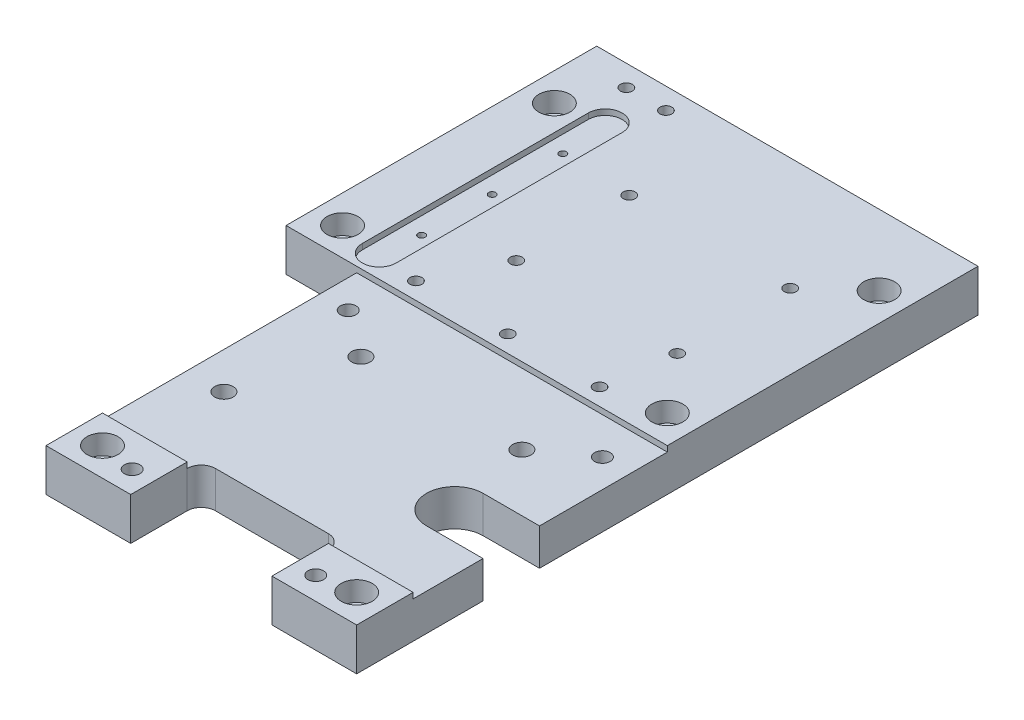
ISO-10303-21;
HEADER;
FILE_DESCRIPTION(('STEP AP214'),'2;1');
FILE_NAME('part.step','',(''),(''),'','','');
FILE_SCHEMA(('AUTOMOTIVE_DESIGN { 1 0 10303 214 1 1 1 1 }'));
ENDSEC;
DATA;
#1=APPLICATION_CONTEXT('core data for automotive mechanical design processes');
#2=APPLICATION_PROTOCOL_DEFINITION('international standard','automotive_design',2000,#1);
#3=PRODUCT_CONTEXT('',#1,'mechanical');
#4=PRODUCT('Part','Part','',(#3));
#5=PRODUCT_RELATED_PRODUCT_CATEGORY('part','',(#4));
#6=PRODUCT_DEFINITION_FORMATION('','',#4);
#7=PRODUCT_DEFINITION_CONTEXT('part definition',#1,'design');
#8=PRODUCT_DEFINITION('design','',#6,#7);
#9=PRODUCT_DEFINITION_SHAPE('','',#8);
#10=(LENGTH_UNIT() NAMED_UNIT(*) SI_UNIT(.MILLI.,.METRE.));
#11=(NAMED_UNIT(*) PLANE_ANGLE_UNIT() SI_UNIT($,.RADIAN.));
#12=(NAMED_UNIT(*) SI_UNIT($,.STERADIAN.) SOLID_ANGLE_UNIT());
#13=UNCERTAINTY_MEASURE_WITH_UNIT(LENGTH_MEASURE(1.E-05),#10,'distance_accuracy_value','');
#14=(GEOMETRIC_REPRESENTATION_CONTEXT(3) GLOBAL_UNCERTAINTY_ASSIGNED_CONTEXT((#13)) GLOBAL_UNIT_ASSIGNED_CONTEXT((#10,
#11,#12)) REPRESENTATION_CONTEXT('',''));
#15=CARTESIAN_POINT('',(0.,0.,0.));
#16=DIRECTION('',(0.,0.,1.));
#17=DIRECTION('',(1.,0.,0.));
#18=AXIS2_PLACEMENT_3D('',#15,#16,#17);
#19=CARTESIAN_POINT('',(47.5000000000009,-205.,212.));
#20=DIRECTION('',(0.,1.,0.));
#21=DIRECTION('',(0.,0.,1.));
#22=AXIS2_PLACEMENT_3D('',#19,#20,#21);
#23=CYLINDRICAL_SURFACE('',#22,2.75);
#24=CARTESIAN_POINT('',(47.5000000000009,15.,212.));
#25=DIRECTION('',(0.,1.,0.));
#26=DIRECTION('',(0.,0.,1.));
#27=AXIS2_PLACEMENT_3D('',#24,#25,#26);
#28=CIRCLE('',#27,2.75);
#29=CARTESIAN_POINT('',(47.5000000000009,15.,214.75));
#30=VERTEX_POINT('',#29);
#31=EDGE_CURVE('E398',#30,#30,#28,.T.);
#32=ORIENTED_EDGE('',*,*,#31,.T.);
#33=EDGE_LOOP('',(#32));
#34=FACE_BOUND('',#33,.T.);
#35=CARTESIAN_POINT('',(47.5000000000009,6.00000000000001,212.));
#36=DIRECTION('',(0.,-1.,0.));
#37=DIRECTION('',(0.,0.,-1.));
#38=AXIS2_PLACEMENT_3D('',#35,#36,#37);
#39=CIRCLE('',#38,2.75);
#40=CARTESIAN_POINT('',(47.5000000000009,6.00000000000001,209.25));
#41=VERTEX_POINT('',#40);
#42=EDGE_CURVE('E38',#41,#41,#39,.F.);
#43=ORIENTED_EDGE('',*,*,#42,.F.);
#44=EDGE_LOOP('',(#43));
#45=FACE_BOUND('',#44,.T.);
#46=ADVANCED_FACE('F34',(#34,#45),#23,.F.);
#47=CARTESIAN_POINT('',(112.5,-205.,212.));
#48=DIRECTION('',(0.,1.,0.));
#49=DIRECTION('',(0.,0.,1.));
#50=AXIS2_PLACEMENT_3D('',#47,#48,#49);
#51=CYLINDRICAL_SURFACE('',#50,2.75);
#52=CARTESIAN_POINT('',(112.5,15.,212.));
#53=DIRECTION('',(0.,1.,0.));
#54=DIRECTION('',(0.,0.,1.));
#55=AXIS2_PLACEMENT_3D('',#52,#53,#54);
#56=CIRCLE('',#55,2.75);
#57=CARTESIAN_POINT('',(112.5,15.,214.75));
#58=VERTEX_POINT('',#57);
#59=EDGE_CURVE('E395',#58,#58,#56,.T.);
#60=ORIENTED_EDGE('',*,*,#59,.T.);
#61=EDGE_LOOP('',(#60));
#62=FACE_BOUND('',#61,.T.);
#63=CARTESIAN_POINT('',(112.5,6.00000000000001,212.));
#64=DIRECTION('',(0.,-1.,0.));
#65=DIRECTION('',(0.,0.,-1.));
#66=AXIS2_PLACEMENT_3D('',#63,#64,#65);
#67=CIRCLE('',#66,2.75);
#68=CARTESIAN_POINT('',(112.5,6.00000000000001,209.25));
#69=VERTEX_POINT('',#68);
#70=EDGE_CURVE('E567',#69,#69,#67,.F.);
#71=ORIENTED_EDGE('',*,*,#70,.F.);
#72=EDGE_LOOP('',(#71));
#73=FACE_BOUND('',#72,.T.);
#74=ADVANCED_FACE('F742',(#62,#73),#51,.F.);
#75=CARTESIAN_POINT('',(108.499999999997,-205.,135.));
#76=DIRECTION('',(0.,1.,0.));
#77=DIRECTION('',(0.,0.,1.));
#78=AXIS2_PLACEMENT_3D('',#75,#76,#77);
#79=CYLINDRICAL_SURFACE('',#78,3.25);
#80=CARTESIAN_POINT('',(108.499999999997,13.,135.));
#81=DIRECTION('',(0.,1.,0.));
#82=DIRECTION('',(0.,0.,1.));
#83=AXIS2_PLACEMENT_3D('',#80,#81,#82);
#84=CIRCLE('',#83,3.25);
#85=CARTESIAN_POINT('',(108.499999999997,13.,138.25));
#86=VERTEX_POINT('',#85);
#87=EDGE_CURVE('E504',#86,#86,#84,.T.);
#88=ORIENTED_EDGE('',*,*,#87,.T.);
#89=EDGE_LOOP('',(#88));
#90=FACE_BOUND('',#89,.T.);
#91=CARTESIAN_POINT('',(108.499999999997,6.00000000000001,135.));
#92=DIRECTION('',(0.,-1.,0.));
#93=DIRECTION('',(0.,0.,-1.));
#94=AXIS2_PLACEMENT_3D('',#91,#92,#93);
#95=CIRCLE('',#94,3.25);
#96=CARTESIAN_POINT('',(108.499999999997,6.00000000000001,131.75));
#97=VERTEX_POINT('',#96);
#98=EDGE_CURVE('E563',#97,#97,#95,.F.);
#99=ORIENTED_EDGE('',*,*,#98,.F.);
#100=EDGE_LOOP('',(#99));
#101=FACE_BOUND('',#100,.T.);
#102=ADVANCED_FACE('F748',(#90,#101),#79,.F.);
#103=CARTESIAN_POINT('',(125.,-205.,123.));
#104=DIRECTION('',(0.,1.,0.));
#105=DIRECTION('',(0.,0.,1.));
#106=AXIS2_PLACEMENT_3D('',#103,#104,#105);
#107=CYLINDRICAL_SURFACE('',#106,2.75);
#108=CARTESIAN_POINT('',(125.,13.,123.));
#109=DIRECTION('',(0.,1.,0.));
#110=DIRECTION('',(0.,0.,1.));
#111=AXIS2_PLACEMENT_3D('',#108,#109,#110);
#112=CIRCLE('',#111,2.75);
#113=CARTESIAN_POINT('',(125.,13.,125.75));
#114=VERTEX_POINT('',#113);
#115=EDGE_CURVE('E399',#114,#114,#112,.T.);
#116=ORIENTED_EDGE('',*,*,#115,.T.);
#117=EDGE_LOOP('',(#116));
#118=FACE_BOUND('',#117,.T.);
#119=CARTESIAN_POINT('',(125.,6.00000000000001,123.));
#120=DIRECTION('',(0.,-1.,0.));
#121=DIRECTION('',(0.,0.,-1.));
#122=AXIS2_PLACEMENT_3D('',#119,#120,#121);
#123=CIRCLE('',#122,2.75);
#124=CARTESIAN_POINT('',(125.,6.00000000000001,120.25));
#125=VERTEX_POINT('',#124);
#126=EDGE_CURVE('E558',#125,#125,#123,.F.);
#127=ORIENTED_EDGE('',*,*,#126,.F.);
#128=EDGE_LOOP('',(#127));
#129=FACE_BOUND('',#128,.T.);
#130=ADVANCED_FACE('F1195',(#118,#129),#107,.F.);
#131=CARTESIAN_POINT('',(38.,-205.,170.));
#132=DIRECTION('',(0.,1.,0.));
#133=DIRECTION('',(0.,0.,1.));
#134=AXIS2_PLACEMENT_3D('',#131,#132,#133);
#135=CYLINDRICAL_SURFACE('',#134,3.25);
#136=CARTESIAN_POINT('',(38.,13.,170.));
#137=DIRECTION('',(0.,1.,0.));
#138=DIRECTION('',(0.,0.,1.));
#139=AXIS2_PLACEMENT_3D('',#136,#137,#138);
#140=CIRCLE('',#139,3.25);
#141=CARTESIAN_POINT('',(38.,13.,173.25));
#142=VERTEX_POINT('',#141);
#143=EDGE_CURVE('E507',#142,#142,#140,.T.);
#144=ORIENTED_EDGE('',*,*,#143,.T.);
#145=EDGE_LOOP('',(#144));
#146=FACE_BOUND('',#145,.T.);
#147=CARTESIAN_POINT('',(38.,6.00000000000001,170.));
#148=DIRECTION('',(0.,-1.,0.));
#149=DIRECTION('',(0.,0.,-1.));
#150=AXIS2_PLACEMENT_3D('',#147,#148,#149);
#151=CIRCLE('',#150,3.25);
#152=CARTESIAN_POINT('',(38.,6.00000000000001,166.75));
#153=VERTEX_POINT('',#152);
#154=EDGE_CURVE('E553',#153,#153,#151,.F.);
#155=ORIENTED_EDGE('',*,*,#154,.F.);
#156=EDGE_LOOP('',(#155));
#157=FACE_BOUND('',#156,.T.);
#158=ADVANCED_FACE('F1204',(#146,#157),#135,.F.);
#159=CARTESIAN_POINT('',(35.,-205.,123.));
#160=DIRECTION('',(0.,1.,0.));
#161=DIRECTION('',(0.,0.,1.));
#162=AXIS2_PLACEMENT_3D('',#159,#160,#161);
#163=CYLINDRICAL_SURFACE('',#162,2.75);
#164=CARTESIAN_POINT('',(35.,13.,123.));
#165=DIRECTION('',(0.,1.,0.));
#166=DIRECTION('',(0.,0.,1.));
#167=AXIS2_PLACEMENT_3D('',#164,#165,#166);
#168=CIRCLE('',#167,2.75);
#169=CARTESIAN_POINT('',(35.,13.,125.75));
#170=VERTEX_POINT('',#169);
#171=EDGE_CURVE('E461',#170,#170,#168,.T.);
#172=ORIENTED_EDGE('',*,*,#171,.T.);
#173=EDGE_LOOP('',(#172));
#174=FACE_BOUND('',#173,.T.);
#175=CARTESIAN_POINT('',(35.,6.00000000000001,123.));
#176=DIRECTION('',(0.,-1.,0.));
#177=DIRECTION('',(0.,0.,-1.));
#178=AXIS2_PLACEMENT_3D('',#175,#176,#177);
#179=CIRCLE('',#178,2.75);
#180=CARTESIAN_POINT('',(35.,6.00000000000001,120.25));
#181=VERTEX_POINT('',#180);
#182=EDGE_CURVE('E549',#181,#181,#179,.F.);
#183=ORIENTED_EDGE('',*,*,#182,.F.);
#184=EDGE_LOOP('',(#183));
#185=FACE_BOUND('',#184,.T.);
#186=ADVANCED_FACE('F1212',(#174,#185),#163,.F.);
#187=CARTESIAN_POINT('',(51.5000000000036,-205.,135.));
#188=DIRECTION('',(0.,1.,0.));
#189=DIRECTION('',(0.,0.,1.));
#190=AXIS2_PLACEMENT_3D('',#187,#188,#189);
#191=CYLINDRICAL_SURFACE('',#190,3.25);
#192=CARTESIAN_POINT('',(51.5000000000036,13.,135.));
#193=DIRECTION('',(0.,1.,0.));
#194=DIRECTION('',(0.,0.,1.));
#195=AXIS2_PLACEMENT_3D('',#192,#193,#194);
#196=CIRCLE('',#195,3.25);
#197=CARTESIAN_POINT('',(51.5000000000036,13.,138.25));
#198=VERTEX_POINT('',#197);
#199=EDGE_CURVE('E501',#198,#198,#196,.T.);
#200=ORIENTED_EDGE('',*,*,#199,.T.);
#201=EDGE_LOOP('',(#200));
#202=FACE_BOUND('',#201,.T.);
#203=CARTESIAN_POINT('',(51.5000000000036,6.00000000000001,135.));
#204=DIRECTION('',(0.,-1.,0.));
#205=DIRECTION('',(0.,0.,-1.));
#206=AXIS2_PLACEMENT_3D('',#203,#204,#205);
#207=CIRCLE('',#206,3.25);
#208=CARTESIAN_POINT('',(51.5000000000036,6.00000000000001,131.75));
#209=VERTEX_POINT('',#208);
#210=EDGE_CURVE('E231',#209,#209,#207,.F.);
#211=ORIENTED_EDGE('',*,*,#210,.F.);
#212=EDGE_LOOP('',(#211));
#213=FACE_BOUND('',#212,.T.);
#214=ADVANCED_FACE('F1221',(#202,#213),#191,.F.);
#215=CARTESIAN_POINT('',(24.9999999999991,-205.,87.));
#216=DIRECTION('',(0.,1.,0.));
#217=DIRECTION('',(0.,0.,1.));
#218=AXIS2_PLACEMENT_3D('',#215,#216,#217);
#219=CYLINDRICAL_SURFACE('',#218,1.25);
#220=CARTESIAN_POINT('',(24.9999999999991,0.,87.));
#221=DIRECTION('',(0.,1.,0.));
#222=DIRECTION('',(0.,0.,1.));
#223=AXIS2_PLACEMENT_3D('',#220,#221,#222);
#224=CIRCLE('',#223,1.25);
#225=CARTESIAN_POINT('',(24.9999999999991,0.,88.25));
#226=VERTEX_POINT('',#225);
#227=EDGE_CURVE('E382',#226,#226,#224,.T.);
#228=ORIENTED_EDGE('',*,*,#227,.F.);
#229=EDGE_LOOP('',(#228));
#230=FACE_BOUND('',#229,.T.);
#231=CARTESIAN_POINT('',(24.9999999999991,13.,87.));
#232=DIRECTION('',(0.,1.,0.));
#233=DIRECTION('',(0.,0.,1.));
#234=AXIS2_PLACEMENT_3D('',#231,#232,#233);
#235=CIRCLE('',#234,1.25);
#236=CARTESIAN_POINT('',(24.9999999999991,13.,88.25));
#237=VERTEX_POINT('',#236);
#238=EDGE_CURVE('E244',#237,#237,#235,.F.);
#239=ORIENTED_EDGE('',*,*,#238,.F.);
#240=EDGE_LOOP('',(#239));
#241=FACE_BOUND('',#240,.T.);
#242=ADVANCED_FACE('F1229',(#230,#241),#219,.F.);
#243=CARTESIAN_POINT('',(25.0000000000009,-205.,62.));
#244=DIRECTION('',(0.,1.,0.));
#245=DIRECTION('',(0.,0.,1.));
#246=AXIS2_PLACEMENT_3D('',#243,#244,#245);
#247=CYLINDRICAL_SURFACE('',#246,1.25);
#248=CARTESIAN_POINT('',(25.0000000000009,0.,62.));
#249=DIRECTION('',(0.,1.,0.));
#250=DIRECTION('',(0.,0.,1.));
#251=AXIS2_PLACEMENT_3D('',#248,#249,#250);
#252=CIRCLE('',#251,1.25);
#253=CARTESIAN_POINT('',(25.0000000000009,0.,63.25));
#254=VERTEX_POINT('',#253);
#255=EDGE_CURVE('E474',#254,#254,#252,.T.);
#256=ORIENTED_EDGE('',*,*,#255,.F.);
#257=EDGE_LOOP('',(#256));
#258=FACE_BOUND('',#257,.T.);
#259=CARTESIAN_POINT('',(25.0000000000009,13.,62.));
#260=DIRECTION('',(0.,1.,0.));
#261=DIRECTION('',(0.,0.,1.));
#262=AXIS2_PLACEMENT_3D('',#259,#260,#261);
#263=CIRCLE('',#262,1.25);
#264=CARTESIAN_POINT('',(25.0000000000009,13.,63.25));
#265=VERTEX_POINT('',#264);
#266=EDGE_CURVE('E241',#265,#265,#263,.F.);
#267=ORIENTED_EDGE('',*,*,#266,.F.);
#268=EDGE_LOOP('',(#267));
#269=FACE_BOUND('',#268,.T.);
#270=ADVANCED_FACE('F1248',(#258,#269),#247,.F.);
#271=CARTESIAN_POINT('',(25.0000000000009,-205.,37.));
#272=DIRECTION('',(0.,1.,0.));
#273=DIRECTION('',(0.,0.,1.));
#274=AXIS2_PLACEMENT_3D('',#271,#272,#273);
#275=CYLINDRICAL_SURFACE('',#274,1.25);
#276=CARTESIAN_POINT('',(25.0000000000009,0.,37.));
#277=DIRECTION('',(0.,1.,0.));
#278=DIRECTION('',(0.,0.,1.));
#279=AXIS2_PLACEMENT_3D('',#276,#277,#278);
#280=CIRCLE('',#279,1.25);
#281=CARTESIAN_POINT('',(25.0000000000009,0.,38.25));
#282=VERTEX_POINT('',#281);
#283=EDGE_CURVE('E477',#282,#282,#280,.T.);
#284=ORIENTED_EDGE('',*,*,#283,.F.);
#285=EDGE_LOOP('',(#284));
#286=FACE_BOUND('',#285,.T.);
#287=CARTESIAN_POINT('',(25.0000000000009,13.,37.));
#288=DIRECTION('',(0.,1.,0.));
#289=DIRECTION('',(0.,0.,1.));
#290=AXIS2_PLACEMENT_3D('',#287,#288,#289);
#291=CIRCLE('',#290,1.25);
#292=CARTESIAN_POINT('',(25.0000000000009,13.,38.25));
#293=VERTEX_POINT('',#292);
#294=EDGE_CURVE('E237',#293,#293,#291,.F.);
#295=ORIENTED_EDGE('',*,*,#294,.F.);
#296=EDGE_LOOP('',(#295));
#297=FACE_BOUND('',#296,.T.);
#298=ADVANCED_FACE('F1257',(#286,#297),#275,.F.);
#299=CARTESIAN_POINT('',(125.,-205.,210.));
#300=DIRECTION('',(0.,1.,0.));
#301=DIRECTION('',(0.,0.,1.));
#302=AXIS2_PLACEMENT_3D('',#299,#300,#301);
#303=CYLINDRICAL_SURFACE('',#302,3.25);
#304=CARTESIAN_POINT('',(125.,0.,210.));
#305=DIRECTION('',(0.,1.,0.));
#306=DIRECTION('',(0.,0.,1.));
#307=AXIS2_PLACEMENT_3D('',#304,#305,#306);
#308=CIRCLE('',#307,3.25);
#309=CARTESIAN_POINT('',(125.,0.,213.25));
#310=VERTEX_POINT('',#309);
#311=EDGE_CURVE('E498',#310,#310,#308,.T.);
#312=ORIENTED_EDGE('',*,*,#311,.F.);
#313=EDGE_LOOP('',(#312));
#314=FACE_BOUND('',#313,.T.);
#315=CARTESIAN_POINT('',(125.,8.00000000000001,210.));
#316=DIRECTION('',(0.,1.,0.));
#317=DIRECTION('',(0.,0.,1.));
#318=AXIS2_PLACEMENT_3D('',#315,#316,#317);
#319=CIRCLE('',#318,3.25);
#320=CARTESIAN_POINT('',(125.,8.00000000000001,213.25));
#321=VERTEX_POINT('',#320);
#322=EDGE_CURVE('E251',#321,#321,#319,.F.);
#323=ORIENTED_EDGE('',*,*,#322,.F.);
#324=EDGE_LOOP('',(#323));
#325=FACE_BOUND('',#324,.T.);
#326=ADVANCED_FACE('F1265',(#314,#325),#303,.F.);
#327=CARTESIAN_POINT('',(35.0000000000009,-205.,210.));
#328=DIRECTION('',(0.,1.,0.));
#329=DIRECTION('',(0.,0.,1.));
#330=AXIS2_PLACEMENT_3D('',#327,#328,#329);
#331=CYLINDRICAL_SURFACE('',#330,3.25);
#332=CARTESIAN_POINT('',(35.0000000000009,0.,210.));
#333=DIRECTION('',(0.,1.,0.));
#334=DIRECTION('',(0.,0.,1.));
#335=AXIS2_PLACEMENT_3D('',#332,#333,#334);
#336=CIRCLE('',#335,3.25);
#337=CARTESIAN_POINT('',(35.0000000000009,0.,213.25));
#338=VERTEX_POINT('',#337);
#339=EDGE_CURVE('E495',#338,#338,#336,.T.);
#340=ORIENTED_EDGE('',*,*,#339,.F.);
#341=EDGE_LOOP('',(#340));
#342=FACE_BOUND('',#341,.T.);
#343=CARTESIAN_POINT('',(35.0000000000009,8.00000000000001,210.));
#344=DIRECTION('',(0.,1.,0.));
#345=DIRECTION('',(0.,0.,1.));
#346=AXIS2_PLACEMENT_3D('',#343,#344,#345);
#347=CIRCLE('',#346,3.25);
#348=CARTESIAN_POINT('',(35.0000000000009,8.00000000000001,213.25));
#349=VERTEX_POINT('',#348);
#350=EDGE_CURVE('E257',#349,#349,#347,.F.);
#351=ORIENTED_EDGE('',*,*,#350,.F.);
#352=EDGE_LOOP('',(#351));
#353=FACE_BOUND('',#352,.T.);
#354=ADVANCED_FACE('F1298',(#342,#353),#331,.F.);
#355=CARTESIAN_POINT('',(125.,-205.,25.));
#356=DIRECTION('',(0.,1.,0.));
#357=DIRECTION('',(0.,0.,1.));
#358=AXIS2_PLACEMENT_3D('',#355,#356,#357);
#359=CYLINDRICAL_SURFACE('',#358,3.25);
#360=CARTESIAN_POINT('',(125.,0.,25.));
#361=DIRECTION('',(0.,1.,0.));
#362=DIRECTION('',(0.,0.,1.));
#363=AXIS2_PLACEMENT_3D('',#360,#361,#362);
#364=CIRCLE('',#363,3.25);
#365=CARTESIAN_POINT('',(125.,0.,28.25));
#366=VERTEX_POINT('',#365);
#367=EDGE_CURVE('E492',#366,#366,#364,.T.);
#368=ORIENTED_EDGE('',*,*,#367,.F.);
#369=EDGE_LOOP('',(#368));
#370=FACE_BOUND('',#369,.T.);
#371=CARTESIAN_POINT('',(125.,8.00000000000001,25.));
#372=DIRECTION('',(0.,1.,0.));
#373=DIRECTION('',(0.,0.,1.));
#374=AXIS2_PLACEMENT_3D('',#371,#372,#373);
#375=CIRCLE('',#374,3.25);
#376=CARTESIAN_POINT('',(125.,8.00000000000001,28.25));
#377=VERTEX_POINT('',#376);
#378=EDGE_CURVE('E264',#377,#377,#375,.F.);
#379=ORIENTED_EDGE('',*,*,#378,.F.);
#380=EDGE_LOOP('',(#379));
#381=FACE_BOUND('',#380,.T.);
#382=ADVANCED_FACE('F1307',(#370,#381),#359,.F.);
#383=CARTESIAN_POINT('',(125.,-205.,100.));
#384=DIRECTION('',(0.,1.,0.));
#385=DIRECTION('',(0.,0.,1.));
#386=AXIS2_PLACEMENT_3D('',#383,#384,#385);
#387=CYLINDRICAL_SURFACE('',#386,3.25);
#388=CARTESIAN_POINT('',(125.,0.,100.));
#389=DIRECTION('',(0.,1.,0.));
#390=DIRECTION('',(0.,0.,1.));
#391=AXIS2_PLACEMENT_3D('',#388,#389,#390);
#392=CIRCLE('',#391,3.25);
#393=CARTESIAN_POINT('',(125.,0.,103.25));
#394=VERTEX_POINT('',#393);
#395=EDGE_CURVE('E489',#394,#394,#392,.T.);
#396=ORIENTED_EDGE('',*,*,#395,.F.);
#397=EDGE_LOOP('',(#396));
#398=FACE_BOUND('',#397,.T.);
#399=CARTESIAN_POINT('',(125.,8.00000000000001,100.));
#400=DIRECTION('',(0.,1.,0.));
#401=DIRECTION('',(0.,0.,1.));
#402=AXIS2_PLACEMENT_3D('',#399,#400,#401);
#403=CIRCLE('',#402,3.25);
#404=CARTESIAN_POINT('',(125.,8.00000000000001,103.25));
#405=VERTEX_POINT('',#404);
#406=EDGE_CURVE('E271',#405,#405,#403,.F.);
#407=ORIENTED_EDGE('',*,*,#406,.F.);
#408=EDGE_LOOP('',(#407));
#409=FACE_BOUND('',#408,.T.);
#410=ADVANCED_FACE('F1316',(#398,#409),#387,.F.);
#411=CARTESIAN_POINT('',(10.0000000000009,-205.,100.));
#412=DIRECTION('',(0.,1.,0.));
#413=DIRECTION('',(0.,0.,1.));
#414=AXIS2_PLACEMENT_3D('',#411,#412,#413);
#415=CYLINDRICAL_SURFACE('',#414,3.25);
#416=CARTESIAN_POINT('',(10.0000000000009,0.,100.));
#417=DIRECTION('',(0.,1.,0.));
#418=DIRECTION('',(0.,0.,1.));
#419=AXIS2_PLACEMENT_3D('',#416,#417,#418);
#420=CIRCLE('',#419,3.25);
#421=CARTESIAN_POINT('',(10.0000000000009,0.,103.25));
#422=VERTEX_POINT('',#421);
#423=EDGE_CURVE('E486',#422,#422,#420,.T.);
#424=ORIENTED_EDGE('',*,*,#423,.F.);
#425=EDGE_LOOP('',(#424));
#426=FACE_BOUND('',#425,.T.);
#427=CARTESIAN_POINT('',(10.0000000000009,8.00000000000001,100.));
#428=DIRECTION('',(0.,1.,0.));
#429=DIRECTION('',(0.,0.,1.));
#430=AXIS2_PLACEMENT_3D('',#427,#428,#429);
#431=CIRCLE('',#430,3.25);
#432=CARTESIAN_POINT('',(10.0000000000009,8.00000000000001,103.25));
#433=VERTEX_POINT('',#432);
#434=EDGE_CURVE('E278',#433,#433,#431,.F.);
#435=ORIENTED_EDGE('',*,*,#434,.F.);
#436=EDGE_LOOP('',(#435));
#437=FACE_BOUND('',#436,.T.);
#438=ADVANCED_FACE('F1325',(#426,#437),#415,.F.);
#439=CARTESIAN_POINT('',(10.,-205.,25.));
#440=DIRECTION('',(0.,1.,0.));
#441=DIRECTION('',(0.,0.,1.));
#442=AXIS2_PLACEMENT_3D('',#439,#440,#441);
#443=CYLINDRICAL_SURFACE('',#442,3.25);
#444=CARTESIAN_POINT('',(10.,0.,25.));
#445=DIRECTION('',(0.,1.,0.));
#446=DIRECTION('',(0.,0.,1.));
#447=AXIS2_PLACEMENT_3D('',#444,#445,#446);
#448=CIRCLE('',#447,3.25);
#449=CARTESIAN_POINT('',(10.,0.,28.25));
#450=VERTEX_POINT('',#449);
#451=EDGE_CURVE('E373',#450,#450,#448,.T.);
#452=ORIENTED_EDGE('',*,*,#451,.F.);
#453=EDGE_LOOP('',(#452));
#454=FACE_BOUND('',#453,.T.);
#455=CARTESIAN_POINT('',(10.,8.00000000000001,25.));
#456=DIRECTION('',(0.,1.,0.));
#457=DIRECTION('',(0.,0.,1.));
#458=AXIS2_PLACEMENT_3D('',#455,#456,#457);
#459=CIRCLE('',#458,3.25);
#460=CARTESIAN_POINT('',(10.,8.00000000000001,28.25));
#461=VERTEX_POINT('',#460);
#462=EDGE_CURVE('E285',#461,#461,#459,.F.);
#463=ORIENTED_EDGE('',*,*,#462,.F.);
#464=EDGE_LOOP('',(#463));
#465=FACE_BOUND('',#464,.T.);
#466=ADVANCED_FACE('F1334',(#454,#465),#443,.F.);
#467=CARTESIAN_POINT('',(0.,0.,220.));
#468=DIRECTION('',(1.,0.,0.));
#469=DIRECTION('',(0.,0.,-1.));
#470=AXIS2_PLACEMENT_3D('',#467,#468,#469);
#471=PLANE('',#470);
#472=DIRECTION('',(0.,0.,-1.));
#473=VECTOR('',#472,1.);
#474=CARTESIAN_POINT('',(0.,0.,220.));
#475=LINE('',#474,#473);
#476=CARTESIAN_POINT('',(9.09494701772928E-13,0.,110.));
#477=VERTEX_POINT('',#476);
#478=CARTESIAN_POINT('',(0.,0.,0.));
#479=VERTEX_POINT('',#478);
#480=EDGE_CURVE('E456',#477,#479,#475,.T.);
#481=ORIENTED_EDGE('',*,*,#480,.F.);
#482=DIRECTION('',(0.,-1.,0.));
#483=VECTOR('',#482,1.);
#484=CARTESIAN_POINT('',(0.,0.,110.));
#485=LINE('',#484,#483);
#486=CARTESIAN_POINT('',(0.,15.,110.));
#487=VERTEX_POINT('',#486);
#488=EDGE_CURVE('E415',#487,#477,#485,.T.);
#489=ORIENTED_EDGE('',*,*,#488,.F.);
#490=DIRECTION('',(0.,0.,-1.));
#491=VECTOR('',#490,1.);
#492=CARTESIAN_POINT('',(0.,15.,220.));
#493=LINE('',#492,#491);
#494=CARTESIAN_POINT('',(0.,15.,0.));
#495=VERTEX_POINT('',#494);
#496=EDGE_CURVE('E436',#487,#495,#493,.T.);
#497=ORIENTED_EDGE('',*,*,#496,.T.);
#498=DIRECTION('',(0.,-1.,0.));
#499=VECTOR('',#498,1.);
#500=CARTESIAN_POINT('',(0.,0.,0.));
#501=LINE('',#500,#499);
#502=EDGE_CURVE('E425',#495,#479,#501,.T.);
#503=ORIENTED_EDGE('',*,*,#502,.T.);
#504=EDGE_LOOP('',(#481,#489,#497,#503));
#505=FACE_BOUND('',#504,.T.);
#506=ADVANCED_FACE('F36',(#505),#471,.F.);
#507=CARTESIAN_POINT('',(134.999999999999,0.,220.));
#508=DIRECTION('',(-1.,0.,0.));
#509=DIRECTION('',(0.,0.,1.));
#510=AXIS2_PLACEMENT_3D('',#507,#508,#509);
#511=PLANE('',#510);
#512=DIRECTION('',(0.,1.,0.));
#513=VECTOR('',#512,1.);
#514=CARTESIAN_POINT('',(135.,-205.,155.25));
#515=LINE('',#514,#513);
#516=CARTESIAN_POINT('',(135.,0.,155.25));
#517=VERTEX_POINT('',#516);
#518=CARTESIAN_POINT('',(135.,13.,155.25));
#519=VERTEX_POINT('',#518);
#520=EDGE_CURVE('E303',#517,#519,#515,.T.);
#521=ORIENTED_EDGE('',*,*,#520,.F.);
#522=DIRECTION('',(0.,0.,-1.));
#523=VECTOR('',#522,1.);
#524=CARTESIAN_POINT('',(134.999999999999,0.,220.));
#525=LINE('',#524,#523);
#526=CARTESIAN_POINT('',(134.999999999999,0.,0.));
#527=VERTEX_POINT('',#526);
#528=EDGE_CURVE('E452',#517,#527,#525,.T.);
#529=ORIENTED_EDGE('',*,*,#528,.T.);
#530=DIRECTION('',(0.,1.,0.));
#531=VECTOR('',#530,1.);
#532=CARTESIAN_POINT('',(134.999999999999,0.,0.));
#533=LINE('',#532,#531);
#534=CARTESIAN_POINT('',(134.999999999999,15.,0.));
#535=VERTEX_POINT('',#534);
#536=EDGE_CURVE('E442',#527,#535,#533,.T.);
#537=ORIENTED_EDGE('',*,*,#536,.T.);
#538=DIRECTION('',(0.,0.,-1.));
#539=VECTOR('',#538,1.);
#540=CARTESIAN_POINT('',(134.999999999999,15.,220.));
#541=LINE('',#540,#539);
#542=CARTESIAN_POINT('',(134.999999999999,15.,110.));
#543=VERTEX_POINT('',#542);
#544=EDGE_CURVE('E448',#543,#535,#541,.T.);
#545=ORIENTED_EDGE('',*,*,#544,.F.);
#546=DIRECTION('',(0.,-1.,0.));
#547=VECTOR('',#546,1.);
#548=CARTESIAN_POINT('',(134.999999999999,13.,110.));
#549=LINE('',#548,#547);
#550=CARTESIAN_POINT('',(134.999999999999,13.,110.));
#551=VERTEX_POINT('',#550);
#552=EDGE_CURVE('E409',#543,#551,#549,.T.);
#553=ORIENTED_EDGE('',*,*,#552,.T.);
#554=DIRECTION('',(0.,0.,1.));
#555=VECTOR('',#554,1.);
#556=CARTESIAN_POINT('',(134.999999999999,13.,200.));
#557=LINE('',#556,#555);
#558=EDGE_CURVE('E403',#551,#519,#557,.T.);
#559=ORIENTED_EDGE('',*,*,#558,.T.);
#560=EDGE_LOOP('',(#521,#529,#537,#545,#553,#559));
#561=FACE_BOUND('',#560,.T.);
#562=ADVANCED_FACE('F695',(#561),#511,.F.);
#563=DIRECTION('',(0.,1.,0.));
#564=VECTOR('',#563,1.);
#565=CARTESIAN_POINT('',(135.,-205.,175.25));
#566=LINE('',#565,#564);
#567=CARTESIAN_POINT('',(135.,0.,175.25));
#568=VERTEX_POINT('',#567);
#569=CARTESIAN_POINT('',(135.,13.,175.25));
#570=VERTEX_POINT('',#569);
#571=EDGE_CURVE('E309',#568,#570,#566,.T.);
#572=ORIENTED_EDGE('',*,*,#571,.T.);
#573=CARTESIAN_POINT('',(134.999999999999,13.,200.));
#574=VERTEX_POINT('',#573);
#575=EDGE_CURVE('E402',#570,#574,#557,.T.);
#576=ORIENTED_EDGE('',*,*,#575,.T.);
#577=DIRECTION('',(0.,1.,0.));
#578=VECTOR('',#577,1.);
#579=CARTESIAN_POINT('',(134.999999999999,13.,200.));
#580=LINE('',#579,#578);
#581=CARTESIAN_POINT('',(134.999999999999,15.,200.));
#582=VERTEX_POINT('',#581);
#583=EDGE_CURVE('E406',#574,#582,#580,.T.);
#584=ORIENTED_EDGE('',*,*,#583,.T.);
#585=CARTESIAN_POINT('',(134.999999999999,15.,220.));
#586=VERTEX_POINT('',#585);
#587=EDGE_CURVE('E449',#586,#582,#541,.T.);
#588=ORIENTED_EDGE('',*,*,#587,.F.);
#589=DIRECTION('',(0.,1.,0.));
#590=VECTOR('',#589,1.);
#591=CARTESIAN_POINT('',(134.999999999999,0.,220.));
#592=LINE('',#591,#590);
#593=CARTESIAN_POINT('',(134.999999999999,0.,220.));
#594=VERTEX_POINT('',#593);
#595=EDGE_CURVE('E430',#594,#586,#592,.T.);
#596=ORIENTED_EDGE('',*,*,#595,.F.);
#597=EDGE_CURVE('E453',#594,#568,#525,.T.);
#598=ORIENTED_EDGE('',*,*,#597,.T.);
#599=EDGE_LOOP('',(#572,#576,#584,#588,#596,#598));
#600=FACE_BOUND('',#599,.T.);
#601=ADVANCED_FACE('F707',(#600),#511,.F.);
#602=CARTESIAN_POINT('',(0.,15.,220.));
#603=DIRECTION('',(0.,-1.,0.));
#604=DIRECTION('',(0.,0.,-1.));
#605=AXIS2_PLACEMENT_3D('',#602,#603,#604);
#606=PLANE('',#605);
#607=CARTESIAN_POINT('',(35.0000000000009,15.,210.));
#608=DIRECTION('',(0.,1.,0.));
#609=DIRECTION('',(0.,0.,1.));
#610=AXIS2_PLACEMENT_3D('',#607,#608,#609);
#611=CIRCLE('',#610,5.5);
#612=CARTESIAN_POINT('',(35.0000000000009,15.,215.5));
#613=VERTEX_POINT('',#612);
#614=EDGE_CURVE('E258',#613,#613,#611,.T.);
#615=ORIENTED_EDGE('',*,*,#614,.F.);
#616=EDGE_LOOP('',(#615));
#617=FACE_BOUND('',#616,.T.);
#618=ORIENTED_EDGE('',*,*,#31,.F.);
#619=EDGE_LOOP('',(#618));
#620=FACE_BOUND('',#619,.T.);
#621=DIRECTION('',(0.,0.,1.));
#622=VECTOR('',#621,1.);
#623=CARTESIAN_POINT('',(25.0000000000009,15.,220.));
#624=LINE('',#623,#622);
#625=CARTESIAN_POINT('',(25.0000000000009,15.,200.));
#626=VERTEX_POINT('',#625);
#627=CARTESIAN_POINT('',(25.0000000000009,15.,220.));
#628=VERTEX_POINT('',#627);
#629=EDGE_CURVE('E289',#626,#628,#624,.T.);
#630=ORIENTED_EDGE('',*,*,#629,.T.);
#631=DIRECTION('',(-1.,0.,0.));
#632=VECTOR('',#631,1.);
#633=CARTESIAN_POINT('',(0.,15.,220.));
#634=LINE('',#633,#632);
#635=CARTESIAN_POINT('',(55.,15.,220.));
#636=VERTEX_POINT('',#635);
#637=EDGE_CURVE('E432',#636,#628,#634,.T.);
#638=ORIENTED_EDGE('',*,*,#637,.F.);
#639=DIRECTION('',(0.,0.,-1.));
#640=VECTOR('',#639,1.);
#641=CARTESIAN_POINT('',(55.,15.,200.));
#642=LINE('',#641,#640);
#643=CARTESIAN_POINT('',(55.,15.,200.));
#644=VERTEX_POINT('',#643);
#645=EDGE_CURVE('E292',#636,#644,#642,.T.);
#646=ORIENTED_EDGE('',*,*,#645,.T.);
#647=DIRECTION('',(1.,0.,0.));
#648=VECTOR('',#647,1.);
#649=CARTESIAN_POINT('',(-85.0000000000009,15.,200.));
#650=LINE('',#649,#648);
#651=EDGE_CURVE('E418',#626,#644,#650,.T.);
#652=ORIENTED_EDGE('',*,*,#651,.F.);
#653=EDGE_LOOP('',(#630,#638,#646,#652));
#654=FACE_BOUND('',#653,.T.);
#655=ADVANCED_FACE('F663',(#617,#620,#654),#606,.F.);
#656=CARTESIAN_POINT('',(125.,15.,210.));
#657=DIRECTION('',(0.,1.,0.));
#658=DIRECTION('',(0.,0.,1.));
#659=AXIS2_PLACEMENT_3D('',#656,#657,#658);
#660=CIRCLE('',#659,5.50000000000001);
#661=CARTESIAN_POINT('',(125.,15.,215.5));
#662=VERTEX_POINT('',#661);
#663=EDGE_CURVE('E247',#662,#662,#660,.T.);
#664=ORIENTED_EDGE('',*,*,#663,.F.);
#665=EDGE_LOOP('',(#664));
#666=FACE_BOUND('',#665,.T.);
#667=ORIENTED_EDGE('',*,*,#59,.F.);
#668=EDGE_LOOP('',(#667));
#669=FACE_BOUND('',#668,.T.);
#670=DIRECTION('',(0.,0.,1.));
#671=VECTOR('',#670,1.);
#672=CARTESIAN_POINT('',(105.,15.,200.));
#673=LINE('',#672,#671);
#674=CARTESIAN_POINT('',(105.,15.,200.));
#675=VERTEX_POINT('',#674);
#676=CARTESIAN_POINT('',(105.,15.,220.));
#677=VERTEX_POINT('',#676);
#678=EDGE_CURVE('E295',#675,#677,#673,.T.);
#679=ORIENTED_EDGE('',*,*,#678,.T.);
#680=EDGE_CURVE('E433',#586,#677,#634,.T.);
#681=ORIENTED_EDGE('',*,*,#680,.F.);
#682=ORIENTED_EDGE('',*,*,#587,.T.);
#683=EDGE_CURVE('E419',#675,#582,#650,.T.);
#684=ORIENTED_EDGE('',*,*,#683,.F.);
#685=EDGE_LOOP('',(#679,#681,#682,#684));
#686=FACE_BOUND('',#685,.T.);
#687=ADVANCED_FACE('F611',(#666,#669,#686),#606,.F.);
#688=CARTESIAN_POINT('',(0.,0.,220.));
#689=DIRECTION('',(0.,1.,0.));
#690=DIRECTION('',(0.,0.,1.));
#691=AXIS2_PLACEMENT_3D('',#688,#689,#690);
#692=PLANE('',#691);
#693=CARTESIAN_POINT('',(47.5000000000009,0.,212.));
#694=DIRECTION('',(0.,-1.,0.));
#695=DIRECTION('',(0.,0.,-1.));
#696=AXIS2_PLACEMENT_3D('',#693,#694,#695);
#697=CIRCLE('',#696,4.74999999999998);
#698=CARTESIAN_POINT('',(47.5000000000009,0.,207.25));
#699=VERTEX_POINT('',#698);
#700=EDGE_CURVE('E583',#699,#699,#697,.T.);
#701=ORIENTED_EDGE('',*,*,#700,.F.);
#702=EDGE_LOOP('',(#701));
#703=FACE_BOUND('',#702,.T.);
#704=CARTESIAN_POINT('',(112.5,0.,212.));
#705=DIRECTION('',(0.,-1.,0.));
#706=DIRECTION('',(0.,0.,-1.));
#707=AXIS2_PLACEMENT_3D('',#704,#705,#706);
#708=CIRCLE('',#707,4.7987739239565);
#709=CARTESIAN_POINT('',(112.5,0.,207.201226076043));
#710=VERTEX_POINT('',#709);
#711=EDGE_CURVE('E576',#710,#710,#708,.T.);
#712=ORIENTED_EDGE('',*,*,#711,.F.);
#713=EDGE_LOOP('',(#712));
#714=FACE_BOUND('',#713,.T.);
#715=CARTESIAN_POINT('',(108.499999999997,0.,135.));
#716=DIRECTION('',(0.,-1.,0.));
#717=DIRECTION('',(0.,0.,-1.));
#718=AXIS2_PLACEMENT_3D('',#715,#716,#717);
#719=CIRCLE('',#718,5.5);
#720=CARTESIAN_POINT('',(108.499999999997,0.,129.5));
#721=VERTEX_POINT('',#720);
#722=EDGE_CURVE('E569',#721,#721,#719,.T.);
#723=ORIENTED_EDGE('',*,*,#722,.F.);
#724=EDGE_LOOP('',(#723));
#725=FACE_BOUND('',#724,.T.);
#726=CARTESIAN_POINT('',(125.,0.,123.));
#727=DIRECTION('',(0.,-1.,0.));
#728=DIRECTION('',(0.,0.,-1.));
#729=AXIS2_PLACEMENT_3D('',#726,#727,#728);
#730=CIRCLE('',#729,4.75000000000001);
#731=CARTESIAN_POINT('',(125.,0.,118.25));
#732=VERTEX_POINT('',#731);
#733=EDGE_CURVE('E565',#732,#732,#730,.T.);
#734=ORIENTED_EDGE('',*,*,#733,.F.);
#735=EDGE_LOOP('',(#734));
#736=FACE_BOUND('',#735,.T.);
#737=CARTESIAN_POINT('',(38.,0.,170.));
#738=DIRECTION('',(0.,-1.,0.));
#739=DIRECTION('',(0.,0.,-1.));
#740=AXIS2_PLACEMENT_3D('',#737,#738,#739);
#741=CIRCLE('',#740,5.50000000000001);
#742=CARTESIAN_POINT('',(38.,0.,164.5));
#743=VERTEX_POINT('',#742);
#744=EDGE_CURVE('E561',#743,#743,#741,.T.);
#745=ORIENTED_EDGE('',*,*,#744,.F.);
#746=EDGE_LOOP('',(#745));
#747=FACE_BOUND('',#746,.T.);
#748=CARTESIAN_POINT('',(35.,0.,123.));
#749=DIRECTION('',(0.,-1.,0.));
#750=DIRECTION('',(0.,0.,-1.));
#751=AXIS2_PLACEMENT_3D('',#748,#749,#750);
#752=CIRCLE('',#751,4.75000000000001);
#753=CARTESIAN_POINT('',(35.,0.,118.25));
#754=VERTEX_POINT('',#753);
#755=EDGE_CURVE('E556',#754,#754,#752,.T.);
#756=ORIENTED_EDGE('',*,*,#755,.F.);
#757=EDGE_LOOP('',(#756));
#758=FACE_BOUND('',#757,.T.);
#759=CARTESIAN_POINT('',(51.5000000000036,0.,135.));
#760=DIRECTION('',(0.,-1.,0.));
#761=DIRECTION('',(0.,0.,-1.));
#762=AXIS2_PLACEMENT_3D('',#759,#760,#761);
#763=CIRCLE('',#762,5.5);
#764=CARTESIAN_POINT('',(51.5000000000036,0.,129.5));
#765=VERTEX_POINT('',#764);
#766=EDGE_CURVE('E224',#765,#765,#763,.T.);
#767=ORIENTED_EDGE('',*,*,#766,.F.);
#768=EDGE_LOOP('',(#767));
#769=FACE_BOUND('',#768,.T.);
#770=CARTESIAN_POINT('',(51.5,0.,40.));
#771=DIRECTION('',(0.,1.,0.));
#772=DIRECTION('',(0.,0.,1.));
#773=AXIS2_PLACEMENT_3D('',#770,#771,#772);
#774=CIRCLE('',#773,2.1);
#775=CARTESIAN_POINT('',(51.5,0.,42.1));
#776=VERTEX_POINT('',#775);
#777=EDGE_CURVE('E394',#776,#776,#774,.T.);
#778=ORIENTED_EDGE('',*,*,#777,.T.);
#779=EDGE_LOOP('',(#778));
#780=FACE_BOUND('',#779,.T.);
#781=CARTESIAN_POINT('',(108.500000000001,0.,40.));
#782=DIRECTION('',(0.,1.,0.));
#783=DIRECTION('',(0.,0.,1.));
#784=AXIS2_PLACEMENT_3D('',#781,#782,#783);
#785=CIRCLE('',#784,2.1);
#786=CARTESIAN_POINT('',(108.500000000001,0.,42.1));
#787=VERTEX_POINT('',#786);
#788=EDGE_CURVE('E390',#787,#787,#785,.T.);
#789=ORIENTED_EDGE('',*,*,#788,.T.);
#790=EDGE_LOOP('',(#789));
#791=FACE_BOUND('',#790,.T.);
#792=CARTESIAN_POINT('',(108.500000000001,0.,80.));
#793=DIRECTION('',(0.,1.,0.));
#794=DIRECTION('',(0.,0.,1.));
#795=AXIS2_PLACEMENT_3D('',#792,#793,#794);
#796=CIRCLE('',#795,2.1);
#797=CARTESIAN_POINT('',(108.500000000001,0.,82.1));
#798=VERTEX_POINT('',#797);
#799=EDGE_CURVE('E386',#798,#798,#796,.T.);
#800=ORIENTED_EDGE('',*,*,#799,.T.);
#801=EDGE_LOOP('',(#800));
#802=FACE_BOUND('',#801,.T.);
#803=CARTESIAN_POINT('',(51.5,0.,80.));
#804=DIRECTION('',(0.,1.,0.));
#805=DIRECTION('',(0.,0.,1.));
#806=AXIS2_PLACEMENT_3D('',#803,#804,#805);
#807=CIRCLE('',#806,2.1);
#808=CARTESIAN_POINT('',(51.5,0.,82.1));
#809=VERTEX_POINT('',#808);
#810=EDGE_CURVE('E381',#809,#809,#807,.T.);
#811=ORIENTED_EDGE('',*,*,#810,.T.);
#812=EDGE_LOOP('',(#811));
#813=FACE_BOUND('',#812,.T.);
#814=ORIENTED_EDGE('',*,*,#227,.T.);
#815=EDGE_LOOP('',(#814));
#816=FACE_BOUND('',#815,.T.);
#817=ORIENTED_EDGE('',*,*,#255,.T.);
#818=EDGE_LOOP('',(#817));
#819=FACE_BOUND('',#818,.T.);
#820=ORIENTED_EDGE('',*,*,#283,.T.);
#821=EDGE_LOOP('',(#820));
#822=FACE_BOUND('',#821,.T.);
#823=CARTESIAN_POINT('',(18.0000000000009,0.,7.5));
#824=DIRECTION('',(0.,1.,0.));
#825=DIRECTION('',(0.,0.,1.));
#826=AXIS2_PLACEMENT_3D('',#823,#824,#825);
#827=CIRCLE('',#826,2.1);
#828=CARTESIAN_POINT('',(18.0000000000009,0.,9.6));
#829=VERTEX_POINT('',#828);
#830=EDGE_CURVE('E377',#829,#829,#827,.T.);
#831=ORIENTED_EDGE('',*,*,#830,.T.);
#832=EDGE_LOOP('',(#831));
#833=FACE_BOUND('',#832,.T.);
#834=CARTESIAN_POINT('',(32.0000000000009,0.,7.5));
#835=DIRECTION('',(0.,1.,0.));
#836=DIRECTION('',(0.,0.,1.));
#837=AXIS2_PLACEMENT_3D('',#834,#835,#836);
#838=CIRCLE('',#837,2.1);
#839=CARTESIAN_POINT('',(32.0000000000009,0.,9.6));
#840=VERTEX_POINT('',#839);
#841=EDGE_CURVE('E372',#840,#840,#838,.T.);
#842=ORIENTED_EDGE('',*,*,#841,.T.);
#843=EDGE_LOOP('',(#842));
#844=FACE_BOUND('',#843,.T.);
#845=ORIENTED_EDGE('',*,*,#451,.T.);
#846=EDGE_LOOP('',(#845));
#847=FACE_BOUND('',#846,.T.);
#848=ORIENTED_EDGE('',*,*,#423,.T.);
#849=EDGE_LOOP('',(#848));
#850=FACE_BOUND('',#849,.T.);
#851=ORIENTED_EDGE('',*,*,#395,.T.);
#852=EDGE_LOOP('',(#851));
#853=FACE_BOUND('',#852,.T.);
#854=ORIENTED_EDGE('',*,*,#367,.T.);
#855=EDGE_LOOP('',(#854));
#856=FACE_BOUND('',#855,.T.);
#857=ORIENTED_EDGE('',*,*,#339,.T.);
#858=EDGE_LOOP('',(#857));
#859=FACE_BOUND('',#858,.T.);
#860=ORIENTED_EDGE('',*,*,#311,.T.);
#861=EDGE_LOOP('',(#860));
#862=FACE_BOUND('',#861,.T.);
#863=CARTESIAN_POINT('',(105.,0.,104.));
#864=DIRECTION('',(0.,1.,0.));
#865=DIRECTION('',(0.,0.,1.));
#866=AXIS2_PLACEMENT_3D('',#863,#864,#865);
#867=CIRCLE('',#866,2.1);
#868=CARTESIAN_POINT('',(105.,0.,106.1));
#869=VERTEX_POINT('',#868);
#870=EDGE_CURVE('E368',#869,#869,#867,.T.);
#871=ORIENTED_EDGE('',*,*,#870,.T.);
#872=EDGE_LOOP('',(#871));
#873=FACE_BOUND('',#872,.T.);
#874=CARTESIAN_POINT('',(72.5000000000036,0.,104.));
#875=DIRECTION('',(0.,1.,0.));
#876=DIRECTION('',(0.,0.,1.));
#877=AXIS2_PLACEMENT_3D('',#874,#875,#876);
#878=CIRCLE('',#877,2.1);
#879=CARTESIAN_POINT('',(72.5000000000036,0.,106.1));
#880=VERTEX_POINT('',#879);
#881=EDGE_CURVE('E364',#880,#880,#878,.T.);
#882=ORIENTED_EDGE('',*,*,#881,.T.);
#883=EDGE_LOOP('',(#882));
#884=FACE_BOUND('',#883,.T.);
#885=CARTESIAN_POINT('',(40.0000000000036,0.,104.));
#886=DIRECTION('',(0.,1.,0.));
#887=DIRECTION('',(0.,0.,1.));
#888=AXIS2_PLACEMENT_3D('',#885,#886,#887);
#889=CIRCLE('',#888,2.1);
#890=CARTESIAN_POINT('',(40.0000000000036,0.,106.1));
#891=VERTEX_POINT('',#890);
#892=EDGE_CURVE('E360',#891,#891,#889,.T.);
#893=ORIENTED_EDGE('',*,*,#892,.T.);
#894=EDGE_LOOP('',(#893));
#895=FACE_BOUND('',#894,.T.);
#896=DIRECTION('',(0.,0.,1.));
#897=VECTOR('',#896,1.);
#898=CARTESIAN_POINT('',(25.0000000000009,0.,220.));
#899=LINE('',#898,#897);
#900=CARTESIAN_POINT('',(25.0000000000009,0.,110.));
#901=VERTEX_POINT('',#900);
#902=CARTESIAN_POINT('',(25.0000000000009,0.,220.));
#903=VERTEX_POINT('',#902);
#904=EDGE_CURVE('E345',#901,#903,#899,.T.);
#905=ORIENTED_EDGE('',*,*,#904,.F.);
#906=DIRECTION('',(1.,0.,0.));
#907=VECTOR('',#906,1.);
#908=CARTESIAN_POINT('',(0.,0.,110.));
#909=LINE('',#908,#907);
#910=EDGE_CURVE('E355',#477,#901,#909,.T.);
#911=ORIENTED_EDGE('',*,*,#910,.F.);
#912=ORIENTED_EDGE('',*,*,#480,.T.);
#913=DIRECTION('',(1.,0.,0.));
#914=VECTOR('',#913,1.);
#915=CARTESIAN_POINT('',(0.,0.,0.));
#916=LINE('',#915,#914);
#917=EDGE_CURVE('E439',#479,#527,#916,.T.);
#918=ORIENTED_EDGE('',*,*,#917,.T.);
#919=ORIENTED_EDGE('',*,*,#528,.F.);
#920=DIRECTION('',(1.,0.,0.));
#921=VECTOR('',#920,1.);
#922=CARTESIAN_POINT('',(0.,0.,155.25));
#923=LINE('',#922,#921);
#924=CARTESIAN_POINT('',(115.,0.,155.25));
#925=VERTEX_POINT('',#924);
#926=EDGE_CURVE('E353',#925,#517,#923,.T.);
#927=ORIENTED_EDGE('',*,*,#926,.F.);
#928=CARTESIAN_POINT('',(115.,0.,165.25));
#929=DIRECTION('',(0.,1.,0.));
#930=DIRECTION('',(0.,0.,1.));
#931=AXIS2_PLACEMENT_3D('',#928,#929,#930);
#932=CIRCLE('',#931,10.);
#933=CARTESIAN_POINT('',(115.,0.,175.25));
#934=VERTEX_POINT('',#933);
#935=EDGE_CURVE('E351',#934,#925,#932,.F.);
#936=ORIENTED_EDGE('',*,*,#935,.F.);
#937=DIRECTION('',(-1.,0.,0.));
#938=VECTOR('',#937,1.);
#939=CARTESIAN_POINT('',(0.,0.,175.25));
#940=LINE('',#939,#938);
#941=EDGE_CURVE('E349',#568,#934,#940,.T.);
#942=ORIENTED_EDGE('',*,*,#941,.F.);
#943=ORIENTED_EDGE('',*,*,#597,.F.);
#944=DIRECTION('',(1.,0.,0.));
#945=VECTOR('',#944,1.);
#946=CARTESIAN_POINT('',(0.,0.,220.));
#947=LINE('',#946,#945);
#948=CARTESIAN_POINT('',(105.,0.,220.));
#949=VERTEX_POINT('',#948);
#950=EDGE_CURVE('E426',#949,#594,#947,.T.);
#951=ORIENTED_EDGE('',*,*,#950,.F.);
#952=DIRECTION('',(0.,0.,1.));
#953=VECTOR('',#952,1.);
#954=CARTESIAN_POINT('',(105.,0.,220.));
#955=LINE('',#954,#953);
#956=CARTESIAN_POINT('',(105.,0.,200.));
#957=VERTEX_POINT('',#956);
#958=EDGE_CURVE('E340',#957,#949,#955,.T.);
#959=ORIENTED_EDGE('',*,*,#958,.F.);
#960=CARTESIAN_POINT('',(100.,0.,200.));
#961=DIRECTION('',(0.,1.,0.));
#962=DIRECTION('',(0.,0.,1.));
#963=AXIS2_PLACEMENT_3D('',#960,#961,#962);
#964=CIRCLE('',#963,5.);
#965=CARTESIAN_POINT('',(100.,0.,195.));
#966=VERTEX_POINT('',#965);
#967=EDGE_CURVE('E338',#966,#957,#964,.F.);
#968=ORIENTED_EDGE('',*,*,#967,.F.);
#969=DIRECTION('',(1.,0.,0.));
#970=VECTOR('',#969,1.);
#971=CARTESIAN_POINT('',(0.,0.,195.));
#972=LINE('',#971,#970);
#973=CARTESIAN_POINT('',(60.,0.,195.));
#974=VERTEX_POINT('',#973);
#975=EDGE_CURVE('E347',#974,#966,#972,.T.);
#976=ORIENTED_EDGE('',*,*,#975,.F.);
#977=CARTESIAN_POINT('',(60.,0.,200.));
#978=DIRECTION('',(0.,1.,0.));
#979=DIRECTION('',(0.,0.,1.));
#980=AXIS2_PLACEMENT_3D('',#977,#978,#979);
#981=CIRCLE('',#980,5.);
#982=CARTESIAN_POINT('',(55.,0.,200.));
#983=VERTEX_POINT('',#982);
#984=EDGE_CURVE('E333',#983,#974,#981,.F.);
#985=ORIENTED_EDGE('',*,*,#984,.F.);
#986=DIRECTION('',(0.,0.,-1.));
#987=VECTOR('',#986,1.);
#988=CARTESIAN_POINT('',(55.,0.,220.));
#989=LINE('',#988,#987);
#990=CARTESIAN_POINT('',(55.,0.,220.));
#991=VERTEX_POINT('',#990);
#992=EDGE_CURVE('E302',#991,#983,#989,.T.);
#993=ORIENTED_EDGE('',*,*,#992,.F.);
#994=EDGE_CURVE('E428',#903,#991,#947,.T.);
#995=ORIENTED_EDGE('',*,*,#994,.F.);
#996=EDGE_LOOP('',(#905,#911,#912,#918,#919,#927,#936,#942,#943,#951,#959,#968,#976,#985,#993,#995));
#997=FACE_BOUND('',#996,.T.);
#998=ADVANCED_FACE('F607',(#703,#714,#725,#736,#747,#758,#769,#780,#791,#802,#813,#816,#819,
#822,#833,#844,#847,#850,#853,#856,#859,#862,#873,#884,#895,#997),#692,.F.);
#999=CARTESIAN_POINT('',(0.,15.,220.));
#1000=DIRECTION('',(0.,0.,-1.));
#1001=DIRECTION('',(-1.,0.,0.));
#1002=AXIS2_PLACEMENT_3D('',#999,#1000,#1001);
#1003=PLANE('',#1002);
#1004=DIRECTION('',(0.,1.,0.));
#1005=VECTOR('',#1004,1.);
#1006=CARTESIAN_POINT('',(25.0000000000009,-205.,220.));
#1007=LINE('',#1006,#1005);
#1008=EDGE_CURVE('E298',#903,#628,#1007,.T.);
#1009=ORIENTED_EDGE('',*,*,#1008,.F.);
#1010=ORIENTED_EDGE('',*,*,#994,.T.);
#1011=DIRECTION('',(0.,1.,0.));
#1012=VECTOR('',#1011,1.);
#1013=CARTESIAN_POINT('',(55.,-205.,220.));
#1014=LINE('',#1013,#1012);
#1015=EDGE_CURVE('E325',#991,#636,#1014,.T.);
#1016=ORIENTED_EDGE('',*,*,#1015,.T.);
#1017=ORIENTED_EDGE('',*,*,#637,.T.);
#1018=EDGE_LOOP('',(#1009,#1010,#1016,#1017));
#1019=FACE_BOUND('',#1018,.T.);
#1020=ADVANCED_FACE('F610',(#1019),#1003,.F.);
#1021=DIRECTION('',(0.,1.,0.));
#1022=VECTOR('',#1021,1.);
#1023=CARTESIAN_POINT('',(105.,-205.,220.));
#1024=LINE('',#1023,#1022);
#1025=EDGE_CURVE('E312',#949,#677,#1024,.T.);
#1026=ORIENTED_EDGE('',*,*,#1025,.F.);
#1027=ORIENTED_EDGE('',*,*,#950,.T.);
#1028=ORIENTED_EDGE('',*,*,#595,.T.);
#1029=ORIENTED_EDGE('',*,*,#680,.T.);
#1030=EDGE_LOOP('',(#1026,#1027,#1028,#1029));
#1031=FACE_BOUND('',#1030,.T.);
#1032=ADVANCED_FACE('F712',(#1031),#1003,.F.);
#1033=CARTESIAN_POINT('',(-85.0000000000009,13.,200.));
#1034=DIRECTION('',(0.,1.,0.));
#1035=DIRECTION('',(0.,0.,1.));
#1036=AXIS2_PLACEMENT_3D('',#1033,#1034,#1035);
#1037=PLANE('',#1036);
#1038=ORIENTED_EDGE('',*,*,#115,.F.);
#1039=EDGE_LOOP('',(#1038));
#1040=FACE_BOUND('',#1039,.T.);
#1041=ORIENTED_EDGE('',*,*,#171,.F.);
#1042=EDGE_LOOP('',(#1041));
#1043=FACE_BOUND('',#1042,.T.);
#1044=ORIENTED_EDGE('',*,*,#199,.F.);
#1045=EDGE_LOOP('',(#1044));
#1046=FACE_BOUND('',#1045,.T.);
#1047=ORIENTED_EDGE('',*,*,#87,.F.);
#1048=EDGE_LOOP('',(#1047));
#1049=FACE_BOUND('',#1048,.T.);
#1050=ORIENTED_EDGE('',*,*,#143,.F.);
#1051=EDGE_LOOP('',(#1050));
#1052=FACE_BOUND('',#1051,.T.);
#1053=DIRECTION('',(1.,0.,0.));
#1054=VECTOR('',#1053,1.);
#1055=CARTESIAN_POINT('',(-85.0000000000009,13.,110.));
#1056=LINE('',#1055,#1054);
#1057=CARTESIAN_POINT('',(25.0000000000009,13.,110.));
#1058=VERTEX_POINT('',#1057);
#1059=EDGE_CURVE('E413',#1058,#551,#1056,.T.);
#1060=ORIENTED_EDGE('',*,*,#1059,.F.);
#1061=DIRECTION('',(0.,0.,1.));
#1062=VECTOR('',#1061,1.);
#1063=CARTESIAN_POINT('',(25.0000000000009,13.,200.));
#1064=LINE('',#1063,#1062);
#1065=CARTESIAN_POINT('',(25.0000000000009,13.,200.));
#1066=VERTEX_POINT('',#1065);
#1067=EDGE_CURVE('E342',#1058,#1066,#1064,.T.);
#1068=ORIENTED_EDGE('',*,*,#1067,.T.);
#1069=DIRECTION('',(1.,0.,0.));
#1070=VECTOR('',#1069,1.);
#1071=CARTESIAN_POINT('',(-85.0000000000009,13.,200.));
#1072=LINE('',#1071,#1070);
#1073=CARTESIAN_POINT('',(55.,13.,200.));
#1074=VERTEX_POINT('',#1073);
#1075=EDGE_CURVE('E421',#1066,#1074,#1072,.T.);
#1076=ORIENTED_EDGE('',*,*,#1075,.T.);
#1077=CARTESIAN_POINT('',(60.,13.,200.));
#1078=DIRECTION('',(0.,1.,0.));
#1079=DIRECTION('',(0.,0.,1.));
#1080=AXIS2_PLACEMENT_3D('',#1077,#1078,#1079);
#1081=CIRCLE('',#1080,5.);
#1082=CARTESIAN_POINT('',(60.,13.,195.));
#1083=VERTEX_POINT('',#1082);
#1084=EDGE_CURVE('E330',#1074,#1083,#1081,.F.);
#1085=ORIENTED_EDGE('',*,*,#1084,.T.);
#1086=DIRECTION('',(1.,0.,0.));
#1087=VECTOR('',#1086,1.);
#1088=CARTESIAN_POINT('',(-85.0000000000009,13.,195.));
#1089=LINE('',#1088,#1087);
#1090=CARTESIAN_POINT('',(100.,13.,195.));
#1091=VERTEX_POINT('',#1090);
#1092=EDGE_CURVE('E524',#1083,#1091,#1089,.T.);
#1093=ORIENTED_EDGE('',*,*,#1092,.T.);
#1094=CARTESIAN_POINT('',(100.,13.,200.));
#1095=DIRECTION('',(0.,1.,0.));
#1096=DIRECTION('',(0.,0.,1.));
#1097=AXIS2_PLACEMENT_3D('',#1094,#1095,#1096);
#1098=CIRCLE('',#1097,5.);
#1099=CARTESIAN_POINT('',(105.,13.,200.));
#1100=VERTEX_POINT('',#1099);
#1101=EDGE_CURVE('E335',#1091,#1100,#1098,.F.);
#1102=ORIENTED_EDGE('',*,*,#1101,.T.);
#1103=EDGE_CURVE('E412',#1100,#574,#1072,.T.);
#1104=ORIENTED_EDGE('',*,*,#1103,.T.);
#1105=ORIENTED_EDGE('',*,*,#575,.F.);
#1106=DIRECTION('',(-1.,0.,0.));
#1107=VECTOR('',#1106,1.);
#1108=CARTESIAN_POINT('',(-85.0000000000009,13.,175.25));
#1109=LINE('',#1108,#1107);
#1110=CARTESIAN_POINT('',(115.,13.,175.25));
#1111=VERTEX_POINT('',#1110);
#1112=EDGE_CURVE('E527',#570,#1111,#1109,.T.);
#1113=ORIENTED_EDGE('',*,*,#1112,.T.);
#1114=CARTESIAN_POINT('',(115.,13.,165.25));
#1115=DIRECTION('',(0.,1.,0.));
#1116=DIRECTION('',(0.,0.,1.));
#1117=AXIS2_PLACEMENT_3D('',#1114,#1115,#1116);
#1118=CIRCLE('',#1117,10.);
#1119=CARTESIAN_POINT('',(115.,13.,155.25));
#1120=VERTEX_POINT('',#1119);
#1121=EDGE_CURVE('E43',#1111,#1120,#1118,.F.);
#1122=ORIENTED_EDGE('',*,*,#1121,.T.);
#1123=DIRECTION('',(1.,0.,0.));
#1124=VECTOR('',#1123,1.);
#1125=CARTESIAN_POINT('',(-85.0000000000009,13.,155.25));
#1126=LINE('',#1125,#1124);
#1127=EDGE_CURVE('E12',#1120,#519,#1126,.T.);
#1128=ORIENTED_EDGE('',*,*,#1127,.T.);
#1129=ORIENTED_EDGE('',*,*,#558,.F.);
#1130=EDGE_LOOP('',(#1060,#1068,#1076,#1085,#1093,#1102,#1104,#1105,#1113,#1122,#1128,#1129));
#1131=FACE_BOUND('',#1130,.T.);
#1132=ADVANCED_FACE('F672',(#1040,#1043,#1046,#1049,#1052,#1131),#1037,.T.);
#1133=CARTESIAN_POINT('',(-85.0000000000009,13.,200.));
#1134=DIRECTION('',(0.,0.,-1.));
#1135=DIRECTION('',(-1.,0.,0.));
#1136=AXIS2_PLACEMENT_3D('',#1133,#1134,#1135);
#1137=PLANE('',#1136);
#1138=ORIENTED_EDGE('',*,*,#1075,.F.);
#1139=DIRECTION('',(0.,1.,0.));
#1140=VECTOR('',#1139,1.);
#1141=CARTESIAN_POINT('',(25.0000000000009,13.,200.));
#1142=LINE('',#1141,#1140);
#1143=EDGE_CURVE('E521',#1066,#626,#1142,.T.);
#1144=ORIENTED_EDGE('',*,*,#1143,.T.);
#1145=ORIENTED_EDGE('',*,*,#651,.T.);
#1146=DIRECTION('',(0.,-1.,0.));
#1147=VECTOR('',#1146,1.);
#1148=CARTESIAN_POINT('',(55.,13.,200.));
#1149=LINE('',#1148,#1147);
#1150=EDGE_CURVE('E458',#644,#1074,#1149,.T.);
#1151=ORIENTED_EDGE('',*,*,#1150,.T.);
#1152=EDGE_LOOP('',(#1138,#1144,#1145,#1151));
#1153=FACE_BOUND('',#1152,.T.);
#1154=ADVANCED_FACE('F668',(#1153),#1137,.T.);
#1155=ORIENTED_EDGE('',*,*,#1103,.F.);
#1156=DIRECTION('',(0.,1.,0.));
#1157=VECTOR('',#1156,1.);
#1158=CARTESIAN_POINT('',(105.,-205.,200.));
#1159=LINE('',#1158,#1157);
#1160=EDGE_CURVE('E518',#1100,#675,#1159,.T.);
#1161=ORIENTED_EDGE('',*,*,#1160,.T.);
#1162=ORIENTED_EDGE('',*,*,#683,.T.);
#1163=ORIENTED_EDGE('',*,*,#583,.F.);
#1164=EDGE_LOOP('',(#1155,#1161,#1162,#1163));
#1165=FACE_BOUND('',#1164,.T.);
#1166=ADVANCED_FACE('F725',(#1165),#1137,.T.);
#1167=DIRECTION('',(0.,0.,-1.));
#1168=VECTOR('',#1167,1.);
#1169=CARTESIAN_POINT('',(31.0000000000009,15.,102.));
#1170=LINE('',#1169,#1168);
#1171=CARTESIAN_POINT('',(31.0000000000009,15.,102.));
#1172=VERTEX_POINT('',#1171);
#1173=CARTESIAN_POINT('',(31.0000000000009,15.,22.));
#1174=VERTEX_POINT('',#1173);
#1175=EDGE_CURVE('E230',#1172,#1174,#1170,.T.);
#1176=ORIENTED_EDGE('',*,*,#1175,.F.);
#1177=CARTESIAN_POINT('',(25.0000000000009,15.,102.));
#1178=DIRECTION('',(0.,1.,0.));
#1179=DIRECTION('',(0.,0.,1.));
#1180=AXIS2_PLACEMENT_3D('',#1177,#1178,#1179);
#1181=CIRCLE('',#1180,6.);
#1182=CARTESIAN_POINT('',(19.0000000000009,15.,102.));
#1183=VERTEX_POINT('',#1182);
#1184=EDGE_CURVE('E51',#1183,#1172,#1181,.T.);
#1185=ORIENTED_EDGE('',*,*,#1184,.F.);
#1186=DIRECTION('',(0.,0.,1.));
#1187=VECTOR('',#1186,1.);
#1188=CARTESIAN_POINT('',(19.0000000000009,15.,102.));
#1189=LINE('',#1188,#1187);
#1190=CARTESIAN_POINT('',(19.0000000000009,15.,22.));
#1191=VERTEX_POINT('',#1190);
#1192=EDGE_CURVE('E218',#1191,#1183,#1189,.T.);
#1193=ORIENTED_EDGE('',*,*,#1192,.F.);
#1194=CARTESIAN_POINT('',(25.0000000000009,15.,22.));
#1195=DIRECTION('',(0.,1.,0.));
#1196=DIRECTION('',(0.,0.,1.));
#1197=AXIS2_PLACEMENT_3D('',#1194,#1195,#1196);
#1198=CIRCLE('',#1197,6.);
#1199=EDGE_CURVE('E221',#1174,#1191,#1198,.T.);
#1200=ORIENTED_EDGE('',*,*,#1199,.F.);
#1201=EDGE_LOOP('',(#1176,#1185,#1193,#1200));
#1202=FACE_BOUND('',#1201,.T.);
#1203=CARTESIAN_POINT('',(125.,15.,25.));
#1204=DIRECTION('',(0.,1.,0.));
#1205=DIRECTION('',(0.,0.,1.));
#1206=AXIS2_PLACEMENT_3D('',#1203,#1204,#1205);
#1207=CIRCLE('',#1206,5.50000000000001);
#1208=CARTESIAN_POINT('',(125.,15.,30.5));
#1209=VERTEX_POINT('',#1208);
#1210=EDGE_CURVE('E265',#1209,#1209,#1207,.T.);
#1211=ORIENTED_EDGE('',*,*,#1210,.F.);
#1212=EDGE_LOOP('',(#1211));
#1213=FACE_BOUND('',#1212,.T.);
#1214=CARTESIAN_POINT('',(125.,15.,100.));
#1215=DIRECTION('',(0.,1.,0.));
#1216=DIRECTION('',(0.,0.,1.));
#1217=AXIS2_PLACEMENT_3D('',#1214,#1215,#1216);
#1218=CIRCLE('',#1217,5.50000000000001);
#1219=CARTESIAN_POINT('',(125.,15.,105.5));
#1220=VERTEX_POINT('',#1219);
#1221=EDGE_CURVE('E272',#1220,#1220,#1218,.T.);
#1222=ORIENTED_EDGE('',*,*,#1221,.F.);
#1223=EDGE_LOOP('',(#1222));
#1224=FACE_BOUND('',#1223,.T.);
#1225=CARTESIAN_POINT('',(10.0000000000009,15.,100.));
#1226=DIRECTION('',(0.,1.,0.));
#1227=DIRECTION('',(0.,0.,1.));
#1228=AXIS2_PLACEMENT_3D('',#1225,#1226,#1227);
#1229=CIRCLE('',#1228,5.5);
#1230=CARTESIAN_POINT('',(10.0000000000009,15.,105.5));
#1231=VERTEX_POINT('',#1230);
#1232=EDGE_CURVE('E279',#1231,#1231,#1229,.T.);
#1233=ORIENTED_EDGE('',*,*,#1232,.F.);
#1234=EDGE_LOOP('',(#1233));
#1235=FACE_BOUND('',#1234,.T.);
#1236=CARTESIAN_POINT('',(10.,15.,25.));
#1237=DIRECTION('',(0.,1.,0.));
#1238=DIRECTION('',(0.,0.,1.));
#1239=AXIS2_PLACEMENT_3D('',#1236,#1237,#1238);
#1240=CIRCLE('',#1239,5.5);
#1241=CARTESIAN_POINT('',(10.,15.,30.5));
#1242=VERTEX_POINT('',#1241);
#1243=EDGE_CURVE('E286',#1242,#1242,#1240,.T.);
#1244=ORIENTED_EDGE('',*,*,#1243,.F.);
#1245=EDGE_LOOP('',(#1244));
#1246=FACE_BOUND('',#1245,.T.);
#1247=CARTESIAN_POINT('',(40.0000000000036,15.,104.));
#1248=DIRECTION('',(0.,1.,0.));
#1249=DIRECTION('',(0.,0.,1.));
#1250=AXIS2_PLACEMENT_3D('',#1247,#1248,#1249);
#1251=CIRCLE('',#1250,2.1);
#1252=CARTESIAN_POINT('',(40.0000000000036,15.,106.1));
#1253=VERTEX_POINT('',#1252);
#1254=EDGE_CURVE('E357',#1253,#1253,#1251,.T.);
#1255=ORIENTED_EDGE('',*,*,#1254,.F.);
#1256=EDGE_LOOP('',(#1255));
#1257=FACE_BOUND('',#1256,.T.);
#1258=CARTESIAN_POINT('',(72.5000000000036,15.,104.));
#1259=DIRECTION('',(0.,1.,0.));
#1260=DIRECTION('',(0.,0.,1.));
#1261=AXIS2_PLACEMENT_3D('',#1258,#1259,#1260);
#1262=CIRCLE('',#1261,2.1);
#1263=CARTESIAN_POINT('',(72.5000000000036,15.,106.1));
#1264=VERTEX_POINT('',#1263);
#1265=EDGE_CURVE('E361',#1264,#1264,#1262,.T.);
#1266=ORIENTED_EDGE('',*,*,#1265,.F.);
#1267=EDGE_LOOP('',(#1266));
#1268=FACE_BOUND('',#1267,.T.);
#1269=CARTESIAN_POINT('',(105.,15.,104.));
#1270=DIRECTION('',(0.,1.,0.));
#1271=DIRECTION('',(0.,0.,1.));
#1272=AXIS2_PLACEMENT_3D('',#1269,#1270,#1271);
#1273=CIRCLE('',#1272,2.1);
#1274=CARTESIAN_POINT('',(105.,15.,106.1));
#1275=VERTEX_POINT('',#1274);
#1276=EDGE_CURVE('E365',#1275,#1275,#1273,.T.);
#1277=ORIENTED_EDGE('',*,*,#1276,.F.);
#1278=EDGE_LOOP('',(#1277));
#1279=FACE_BOUND('',#1278,.T.);
#1280=CARTESIAN_POINT('',(32.0000000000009,15.,7.5));
#1281=DIRECTION('',(0.,1.,0.));
#1282=DIRECTION('',(0.,0.,1.));
#1283=AXIS2_PLACEMENT_3D('',#1280,#1281,#1282);
#1284=CIRCLE('',#1283,2.1);
#1285=CARTESIAN_POINT('',(32.0000000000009,15.,9.6));
#1286=VERTEX_POINT('',#1285);
#1287=EDGE_CURVE('E369',#1286,#1286,#1284,.T.);
#1288=ORIENTED_EDGE('',*,*,#1287,.F.);
#1289=EDGE_LOOP('',(#1288));
#1290=FACE_BOUND('',#1289,.T.);
#1291=CARTESIAN_POINT('',(18.0000000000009,15.,7.5));
#1292=DIRECTION('',(0.,1.,0.));
#1293=DIRECTION('',(0.,0.,1.));
#1294=AXIS2_PLACEMENT_3D('',#1291,#1292,#1293);
#1295=CIRCLE('',#1294,2.1);
#1296=CARTESIAN_POINT('',(18.0000000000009,15.,9.6));
#1297=VERTEX_POINT('',#1296);
#1298=EDGE_CURVE('E374',#1297,#1297,#1295,.T.);
#1299=ORIENTED_EDGE('',*,*,#1298,.F.);
#1300=EDGE_LOOP('',(#1299));
#1301=FACE_BOUND('',#1300,.T.);
#1302=CARTESIAN_POINT('',(51.5,15.,80.));
#1303=DIRECTION('',(0.,1.,0.));
#1304=DIRECTION('',(0.,0.,1.));
#1305=AXIS2_PLACEMENT_3D('',#1302,#1303,#1304);
#1306=CIRCLE('',#1305,2.1);
#1307=CARTESIAN_POINT('',(51.5,15.,82.1));
#1308=VERTEX_POINT('',#1307);
#1309=EDGE_CURVE('E378',#1308,#1308,#1306,.T.);
#1310=ORIENTED_EDGE('',*,*,#1309,.F.);
#1311=EDGE_LOOP('',(#1310));
#1312=FACE_BOUND('',#1311,.T.);
#1313=CARTESIAN_POINT('',(108.500000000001,15.,80.));
#1314=DIRECTION('',(0.,1.,0.));
#1315=DIRECTION('',(0.,0.,1.));
#1316=AXIS2_PLACEMENT_3D('',#1313,#1314,#1315);
#1317=CIRCLE('',#1316,2.1);
#1318=CARTESIAN_POINT('',(108.500000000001,15.,82.1));
#1319=VERTEX_POINT('',#1318);
#1320=EDGE_CURVE('E383',#1319,#1319,#1317,.T.);
#1321=ORIENTED_EDGE('',*,*,#1320,.F.);
#1322=EDGE_LOOP('',(#1321));
#1323=FACE_BOUND('',#1322,.T.);
#1324=CARTESIAN_POINT('',(108.500000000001,15.,40.));
#1325=DIRECTION('',(0.,1.,0.));
#1326=DIRECTION('',(0.,0.,1.));
#1327=AXIS2_PLACEMENT_3D('',#1324,#1325,#1326);
#1328=CIRCLE('',#1327,2.1);
#1329=CARTESIAN_POINT('',(108.500000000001,15.,42.1));
#1330=VERTEX_POINT('',#1329);
#1331=EDGE_CURVE('E387',#1330,#1330,#1328,.T.);
#1332=ORIENTED_EDGE('',*,*,#1331,.F.);
#1333=EDGE_LOOP('',(#1332));
#1334=FACE_BOUND('',#1333,.T.);
#1335=CARTESIAN_POINT('',(51.5,15.,40.));
#1336=DIRECTION('',(0.,1.,0.));
#1337=DIRECTION('',(0.,0.,1.));
#1338=AXIS2_PLACEMENT_3D('',#1335,#1336,#1337);
#1339=CIRCLE('',#1338,2.1);
#1340=CARTESIAN_POINT('',(51.5,15.,42.1));
#1341=VERTEX_POINT('',#1340);
#1342=EDGE_CURVE('E391',#1341,#1341,#1339,.T.);
#1343=ORIENTED_EDGE('',*,*,#1342,.F.);
#1344=EDGE_LOOP('',(#1343));
#1345=FACE_BOUND('',#1344,.T.);
#1346=DIRECTION('',(1.,0.,0.));
#1347=VECTOR('',#1346,1.);
#1348=CARTESIAN_POINT('',(-85.0000000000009,15.,110.));
#1349=LINE('',#1348,#1347);
#1350=EDGE_CURVE('E416',#487,#543,#1349,.T.);
#1351=ORIENTED_EDGE('',*,*,#1350,.T.);
#1352=ORIENTED_EDGE('',*,*,#544,.T.);
#1353=DIRECTION('',(-1.,0.,0.));
#1354=VECTOR('',#1353,1.);
#1355=CARTESIAN_POINT('',(0.,15.,0.));
#1356=LINE('',#1355,#1354);
#1357=EDGE_CURVE('E429',#535,#495,#1356,.T.);
#1358=ORIENTED_EDGE('',*,*,#1357,.T.);
#1359=ORIENTED_EDGE('',*,*,#496,.F.);
#1360=EDGE_LOOP('',(#1351,#1352,#1358,#1359));
#1361=FACE_BOUND('',#1360,.T.);
#1362=ADVANCED_FACE('F682',(#1202,#1213,#1224,#1235,#1246,#1257,#1268,#1279,#1290,#1301,#1312,
#1323,#1334,#1345,#1361),#606,.F.);
#1363=CARTESIAN_POINT('',(0.,15.,0.));
#1364=DIRECTION('',(0.,0.,-1.));
#1365=DIRECTION('',(-1.,0.,0.));
#1366=AXIS2_PLACEMENT_3D('',#1363,#1364,#1365);
#1367=PLANE('',#1366);
#1368=ORIENTED_EDGE('',*,*,#502,.F.);
#1369=ORIENTED_EDGE('',*,*,#1357,.F.);
#1370=ORIENTED_EDGE('',*,*,#536,.F.);
#1371=ORIENTED_EDGE('',*,*,#917,.F.);
#1372=EDGE_LOOP('',(#1368,#1369,#1370,#1371));
#1373=FACE_BOUND('',#1372,.T.);
#1374=ADVANCED_FACE('F689',(#1373),#1367,.T.);
#1375=CARTESIAN_POINT('',(-85.0000000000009,13.,110.));
#1376=DIRECTION('',(0.,0.,1.));
#1377=DIRECTION('',(1.,0.,0.));
#1378=AXIS2_PLACEMENT_3D('',#1375,#1376,#1377);
#1379=PLANE('',#1378);
#1380=ORIENTED_EDGE('',*,*,#488,.T.);
#1381=ORIENTED_EDGE('',*,*,#910,.T.);
#1382=DIRECTION('',(0.,1.,0.));
#1383=VECTOR('',#1382,1.);
#1384=CARTESIAN_POINT('',(25.0000000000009,-205.,110.));
#1385=LINE('',#1384,#1383);
#1386=EDGE_CURVE('E299',#901,#1058,#1385,.T.);
#1387=ORIENTED_EDGE('',*,*,#1386,.T.);
#1388=ORIENTED_EDGE('',*,*,#1059,.T.);
#1389=ORIENTED_EDGE('',*,*,#552,.F.);
#1390=ORIENTED_EDGE('',*,*,#1350,.F.);
#1391=EDGE_LOOP('',(#1380,#1381,#1387,#1388,#1389,#1390));
#1392=FACE_BOUND('',#1391,.T.);
#1393=ADVANCED_FACE('F676',(#1392),#1379,.T.);
#1394=CARTESIAN_POINT('',(51.5,-205.,40.));
#1395=DIRECTION('',(0.,1.,0.));
#1396=DIRECTION('',(0.,0.,1.));
#1397=AXIS2_PLACEMENT_3D('',#1394,#1395,#1396);
#1398=CYLINDRICAL_SURFACE('',#1397,2.1);
#1399=ORIENTED_EDGE('',*,*,#1342,.T.);
#1400=EDGE_LOOP('',(#1399));
#1401=FACE_BOUND('',#1400,.T.);
#1402=ORIENTED_EDGE('',*,*,#777,.F.);
#1403=EDGE_LOOP('',(#1402));
#1404=FACE_BOUND('',#1403,.T.);
#1405=ADVANCED_FACE('F756',(#1401,#1404),#1398,.F.);
#1406=CARTESIAN_POINT('',(108.500000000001,-205.,40.));
#1407=DIRECTION('',(0.,1.,0.));
#1408=DIRECTION('',(0.,0.,1.));
#1409=AXIS2_PLACEMENT_3D('',#1406,#1407,#1408);
#1410=CYLINDRICAL_SURFACE('',#1409,2.1);
#1411=ORIENTED_EDGE('',*,*,#1331,.T.);
#1412=EDGE_LOOP('',(#1411));
#1413=FACE_BOUND('',#1412,.T.);
#1414=ORIENTED_EDGE('',*,*,#788,.F.);
#1415=EDGE_LOOP('',(#1414));
#1416=FACE_BOUND('',#1415,.T.);
#1417=ADVANCED_FACE('F781',(#1413,#1416),#1410,.F.);
#1418=CARTESIAN_POINT('',(108.500000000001,-205.,80.));
#1419=DIRECTION('',(0.,1.,0.));
#1420=DIRECTION('',(0.,0.,1.));
#1421=AXIS2_PLACEMENT_3D('',#1418,#1419,#1420);
#1422=CYLINDRICAL_SURFACE('',#1421,2.1);
#1423=ORIENTED_EDGE('',*,*,#1320,.T.);
#1424=EDGE_LOOP('',(#1423));
#1425=FACE_BOUND('',#1424,.T.);
#1426=ORIENTED_EDGE('',*,*,#799,.F.);
#1427=EDGE_LOOP('',(#1426));
#1428=FACE_BOUND('',#1427,.T.);
#1429=ADVANCED_FACE('F789',(#1425,#1428),#1422,.F.);
#1430=CARTESIAN_POINT('',(51.5,-205.,80.));
#1431=DIRECTION('',(0.,1.,0.));
#1432=DIRECTION('',(0.,0.,1.));
#1433=AXIS2_PLACEMENT_3D('',#1430,#1431,#1432);
#1434=CYLINDRICAL_SURFACE('',#1433,2.1);
#1435=ORIENTED_EDGE('',*,*,#1309,.T.);
#1436=EDGE_LOOP('',(#1435));
#1437=FACE_BOUND('',#1436,.T.);
#1438=ORIENTED_EDGE('',*,*,#810,.F.);
#1439=EDGE_LOOP('',(#1438));
#1440=FACE_BOUND('',#1439,.T.);
#1441=ADVANCED_FACE('F797',(#1437,#1440),#1434,.F.);
#1442=CARTESIAN_POINT('',(18.0000000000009,-205.,7.5));
#1443=DIRECTION('',(0.,1.,0.));
#1444=DIRECTION('',(0.,0.,1.));
#1445=AXIS2_PLACEMENT_3D('',#1442,#1443,#1444);
#1446=CYLINDRICAL_SURFACE('',#1445,2.1);
#1447=ORIENTED_EDGE('',*,*,#1298,.T.);
#1448=EDGE_LOOP('',(#1447));
#1449=FACE_BOUND('',#1448,.T.);
#1450=ORIENTED_EDGE('',*,*,#830,.F.);
#1451=EDGE_LOOP('',(#1450));
#1452=FACE_BOUND('',#1451,.T.);
#1453=ADVANCED_FACE('F805',(#1449,#1452),#1446,.F.);
#1454=CARTESIAN_POINT('',(32.0000000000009,-205.,7.5));
#1455=DIRECTION('',(0.,1.,0.));
#1456=DIRECTION('',(0.,0.,1.));
#1457=AXIS2_PLACEMENT_3D('',#1454,#1455,#1456);
#1458=CYLINDRICAL_SURFACE('',#1457,2.1);
#1459=ORIENTED_EDGE('',*,*,#1287,.T.);
#1460=EDGE_LOOP('',(#1459));
#1461=FACE_BOUND('',#1460,.T.);
#1462=ORIENTED_EDGE('',*,*,#841,.F.);
#1463=EDGE_LOOP('',(#1462));
#1464=FACE_BOUND('',#1463,.T.);
#1465=ADVANCED_FACE('F813',(#1461,#1464),#1458,.F.);
#1466=CARTESIAN_POINT('',(105.,-205.,104.));
#1467=DIRECTION('',(0.,1.,0.));
#1468=DIRECTION('',(0.,0.,1.));
#1469=AXIS2_PLACEMENT_3D('',#1466,#1467,#1468);
#1470=CYLINDRICAL_SURFACE('',#1469,2.1);
#1471=ORIENTED_EDGE('',*,*,#1276,.T.);
#1472=EDGE_LOOP('',(#1471));
#1473=FACE_BOUND('',#1472,.T.);
#1474=ORIENTED_EDGE('',*,*,#870,.F.);
#1475=EDGE_LOOP('',(#1474));
#1476=FACE_BOUND('',#1475,.T.);
#1477=ADVANCED_FACE('F821',(#1473,#1476),#1470,.F.);
#1478=CARTESIAN_POINT('',(72.5000000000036,-205.,104.));
#1479=DIRECTION('',(0.,1.,0.));
#1480=DIRECTION('',(0.,0.,1.));
#1481=AXIS2_PLACEMENT_3D('',#1478,#1479,#1480);
#1482=CYLINDRICAL_SURFACE('',#1481,2.1);
#1483=ORIENTED_EDGE('',*,*,#1265,.T.);
#1484=EDGE_LOOP('',(#1483));
#1485=FACE_BOUND('',#1484,.T.);
#1486=ORIENTED_EDGE('',*,*,#881,.F.);
#1487=EDGE_LOOP('',(#1486));
#1488=FACE_BOUND('',#1487,.T.);
#1489=ADVANCED_FACE('F829',(#1485,#1488),#1482,.F.);
#1490=CARTESIAN_POINT('',(40.0000000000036,-205.,104.));
#1491=DIRECTION('',(0.,1.,0.));
#1492=DIRECTION('',(0.,0.,1.));
#1493=AXIS2_PLACEMENT_3D('',#1490,#1491,#1492);
#1494=CYLINDRICAL_SURFACE('',#1493,2.1);
#1495=ORIENTED_EDGE('',*,*,#1254,.T.);
#1496=EDGE_LOOP('',(#1495));
#1497=FACE_BOUND('',#1496,.T.);
#1498=ORIENTED_EDGE('',*,*,#892,.F.);
#1499=EDGE_LOOP('',(#1498));
#1500=FACE_BOUND('',#1499,.T.);
#1501=ADVANCED_FACE('F837',(#1497,#1500),#1494,.F.);
#1502=CARTESIAN_POINT('',(105.,-205.,200.));
#1503=DIRECTION('',(-1.,0.,0.));
#1504=DIRECTION('',(0.,0.,1.));
#1505=AXIS2_PLACEMENT_3D('',#1502,#1503,#1504);
#1506=PLANE('',#1505);
#1507=ORIENTED_EDGE('',*,*,#958,.T.);
#1508=ORIENTED_EDGE('',*,*,#1025,.T.);
#1509=ORIENTED_EDGE('',*,*,#678,.F.);
#1510=ORIENTED_EDGE('',*,*,#1160,.F.);
#1511=DIRECTION('',(0.,1.,0.));
#1512=VECTOR('',#1511,1.);
#1513=CARTESIAN_POINT('',(105.,-205.,200.));
#1514=LINE('',#1513,#1512);
#1515=EDGE_CURVE('E314',#957,#1100,#1514,.T.);
#1516=ORIENTED_EDGE('',*,*,#1515,.F.);
#1517=EDGE_LOOP('',(#1507,#1508,#1509,#1510,#1516));
#1518=FACE_BOUND('',#1517,.T.);
#1519=ADVANCED_FACE('F718',(#1518),#1506,.T.);
#1520=CARTESIAN_POINT('',(55.,-205.,200.));
#1521=DIRECTION('',(1.,0.,0.));
#1522=DIRECTION('',(0.,0.,-1.));
#1523=AXIS2_PLACEMENT_3D('',#1520,#1521,#1522);
#1524=PLANE('',#1523);
#1525=ORIENTED_EDGE('',*,*,#992,.T.);
#1526=DIRECTION('',(0.,1.,0.));
#1527=VECTOR('',#1526,1.);
#1528=CARTESIAN_POINT('',(55.,-205.,200.));
#1529=LINE('',#1528,#1527);
#1530=EDGE_CURVE('E323',#983,#1074,#1529,.T.);
#1531=ORIENTED_EDGE('',*,*,#1530,.T.);
#1532=ORIENTED_EDGE('',*,*,#1150,.F.);
#1533=ORIENTED_EDGE('',*,*,#645,.F.);
#1534=ORIENTED_EDGE('',*,*,#1015,.F.);
#1535=EDGE_LOOP('',(#1525,#1531,#1532,#1533,#1534));
#1536=FACE_BOUND('',#1535,.T.);
#1537=ADVANCED_FACE('F852',(#1536),#1524,.T.);
#1538=CARTESIAN_POINT('',(60.,-205.,200.));
#1539=DIRECTION('',(0.,1.,0.));
#1540=DIRECTION('',(0.,0.,1.));
#1541=AXIS2_PLACEMENT_3D('',#1538,#1539,#1540);
#1542=CYLINDRICAL_SURFACE('',#1541,5.);
#1543=ORIENTED_EDGE('',*,*,#984,.T.);
#1544=DIRECTION('',(0.,1.,0.));
#1545=VECTOR('',#1544,1.);
#1546=CARTESIAN_POINT('',(60.,-205.,195.));
#1547=LINE('',#1546,#1545);
#1548=EDGE_CURVE('E320',#974,#1083,#1547,.T.);
#1549=ORIENTED_EDGE('',*,*,#1548,.T.);
#1550=ORIENTED_EDGE('',*,*,#1084,.F.);
#1551=ORIENTED_EDGE('',*,*,#1530,.F.);
#1552=EDGE_LOOP('',(#1543,#1549,#1550,#1551));
#1553=FACE_BOUND('',#1552,.T.);
#1554=ADVANCED_FACE('F859',(#1553),#1542,.F.);
#1555=CARTESIAN_POINT('',(60.,-205.,195.));
#1556=DIRECTION('',(0.,0.,1.));
#1557=DIRECTION('',(1.,0.,0.));
#1558=AXIS2_PLACEMENT_3D('',#1555,#1556,#1557);
#1559=PLANE('',#1558);
#1560=ORIENTED_EDGE('',*,*,#975,.T.);
#1561=DIRECTION('',(0.,1.,0.));
#1562=VECTOR('',#1561,1.);
#1563=CARTESIAN_POINT('',(100.,-205.,195.));
#1564=LINE('',#1563,#1562);
#1565=EDGE_CURVE('E317',#966,#1091,#1564,.T.);
#1566=ORIENTED_EDGE('',*,*,#1565,.T.);
#1567=ORIENTED_EDGE('',*,*,#1092,.F.);
#1568=ORIENTED_EDGE('',*,*,#1548,.F.);
#1569=EDGE_LOOP('',(#1560,#1566,#1567,#1568));
#1570=FACE_BOUND('',#1569,.T.);
#1571=ADVANCED_FACE('F867',(#1570),#1559,.T.);
#1572=CARTESIAN_POINT('',(100.,-205.,200.));
#1573=DIRECTION('',(0.,1.,0.));
#1574=DIRECTION('',(0.,0.,1.));
#1575=AXIS2_PLACEMENT_3D('',#1572,#1573,#1574);
#1576=CYLINDRICAL_SURFACE('',#1575,5.);
#1577=ORIENTED_EDGE('',*,*,#967,.T.);
#1578=ORIENTED_EDGE('',*,*,#1515,.T.);
#1579=ORIENTED_EDGE('',*,*,#1101,.F.);
#1580=ORIENTED_EDGE('',*,*,#1565,.F.);
#1581=EDGE_LOOP('',(#1577,#1578,#1579,#1580));
#1582=FACE_BOUND('',#1581,.T.);
#1583=ADVANCED_FACE('F720',(#1582),#1576,.F.);
#1584=CARTESIAN_POINT('',(25.0000000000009,-205.,220.));
#1585=DIRECTION('',(-1.,0.,0.));
#1586=DIRECTION('',(0.,0.,1.));
#1587=AXIS2_PLACEMENT_3D('',#1584,#1585,#1586);
#1588=PLANE('',#1587);
#1589=ORIENTED_EDGE('',*,*,#904,.T.);
#1590=ORIENTED_EDGE('',*,*,#1008,.T.);
#1591=ORIENTED_EDGE('',*,*,#629,.F.);
#1592=ORIENTED_EDGE('',*,*,#1143,.F.);
#1593=ORIENTED_EDGE('',*,*,#1067,.F.);
#1594=ORIENTED_EDGE('',*,*,#1386,.F.);
#1595=EDGE_LOOP('',(#1589,#1590,#1591,#1592,#1593,#1594));
#1596=FACE_BOUND('',#1595,.T.);
#1597=ADVANCED_FACE('F658',(#1596),#1588,.T.);
#1598=CARTESIAN_POINT('',(115.,-205.,155.25));
#1599=DIRECTION('',(0.,0.,1.));
#1600=DIRECTION('',(1.,0.,0.));
#1601=AXIS2_PLACEMENT_3D('',#1598,#1599,#1600);
#1602=PLANE('',#1601);
#1603=ORIENTED_EDGE('',*,*,#926,.T.);
#1604=ORIENTED_EDGE('',*,*,#520,.T.);
#1605=ORIENTED_EDGE('',*,*,#1127,.F.);
#1606=DIRECTION('',(0.,1.,0.));
#1607=VECTOR('',#1606,1.);
#1608=CARTESIAN_POINT('',(115.,-205.,155.25));
#1609=LINE('',#1608,#1607);
#1610=EDGE_CURVE('E305',#925,#1120,#1609,.T.);
#1611=ORIENTED_EDGE('',*,*,#1610,.F.);
#1612=EDGE_LOOP('',(#1603,#1604,#1605,#1611));
#1613=FACE_BOUND('',#1612,.T.);
#1614=ADVANCED_FACE('F697',(#1613),#1602,.T.);
#1615=CARTESIAN_POINT('',(115.,-205.,165.25));
#1616=DIRECTION('',(0.,1.,0.));
#1617=DIRECTION('',(0.,0.,1.));
#1618=AXIS2_PLACEMENT_3D('',#1615,#1616,#1617);
#1619=CYLINDRICAL_SURFACE('',#1618,10.);
#1620=ORIENTED_EDGE('',*,*,#935,.T.);
#1621=ORIENTED_EDGE('',*,*,#1610,.T.);
#1622=ORIENTED_EDGE('',*,*,#1121,.F.);
#1623=DIRECTION('',(0.,1.,0.));
#1624=VECTOR('',#1623,1.);
#1625=CARTESIAN_POINT('',(115.,-205.,175.25));
#1626=LINE('',#1625,#1624);
#1627=EDGE_CURVE('E59',#934,#1111,#1626,.T.);
#1628=ORIENTED_EDGE('',*,*,#1627,.F.);
#1629=EDGE_LOOP('',(#1620,#1621,#1622,#1628));
#1630=FACE_BOUND('',#1629,.T.);
#1631=ADVANCED_FACE('F701',(#1630),#1619,.F.);
#1632=CARTESIAN_POINT('',(115.,-205.,175.25));
#1633=DIRECTION('',(0.,0.,-1.));
#1634=DIRECTION('',(-1.,0.,0.));
#1635=AXIS2_PLACEMENT_3D('',#1632,#1633,#1634);
#1636=PLANE('',#1635);
#1637=ORIENTED_EDGE('',*,*,#941,.T.);
#1638=ORIENTED_EDGE('',*,*,#1627,.T.);
#1639=ORIENTED_EDGE('',*,*,#1112,.F.);
#1640=ORIENTED_EDGE('',*,*,#571,.F.);
#1641=EDGE_LOOP('',(#1637,#1638,#1639,#1640));
#1642=FACE_BOUND('',#1641,.T.);
#1643=ADVANCED_FACE('F900',(#1642),#1636,.T.);
#1644=CARTESIAN_POINT('',(10.,8.,25.));
#1645=DIRECTION('',(0.,1.,0.));
#1646=DIRECTION('',(0.,0.,1.));
#1647=AXIS2_PLACEMENT_3D('',#1644,#1645,#1646);
#1648=PLANE('',#1647);
#1649=CARTESIAN_POINT('',(10.,8.,25.));
#1650=DIRECTION('',(0.,1.,0.));
#1651=DIRECTION('',(0.,0.,1.));
#1652=AXIS2_PLACEMENT_3D('',#1649,#1650,#1651);
#1653=CIRCLE('',#1652,5.5);
#1654=CARTESIAN_POINT('',(10.,8.,30.5));
#1655=VERTEX_POINT('',#1654);
#1656=EDGE_CURVE('E282',#1655,#1655,#1653,.T.);
#1657=ORIENTED_EDGE('',*,*,#1656,.T.);
#1658=EDGE_LOOP('',(#1657));
#1659=FACE_BOUND('',#1658,.T.);
#1660=ORIENTED_EDGE('',*,*,#462,.T.);
#1661=EDGE_LOOP('',(#1660));
#1662=FACE_BOUND('',#1661,.T.);
#1663=ADVANCED_FACE('F907',(#1659,#1662),#1648,.T.);
#1664=CARTESIAN_POINT('',(10.,8.,25.));
#1665=DIRECTION('',(0.,1.,0.));
#1666=DIRECTION('',(0.,0.,1.));
#1667=AXIS2_PLACEMENT_3D('',#1664,#1665,#1666);
#1668=CYLINDRICAL_SURFACE('',#1667,5.5);
#1669=ORIENTED_EDGE('',*,*,#1656,.F.);
#1670=EDGE_LOOP('',(#1669));
#1671=FACE_BOUND('',#1670,.T.);
#1672=ORIENTED_EDGE('',*,*,#1243,.T.);
#1673=EDGE_LOOP('',(#1672));
#1674=FACE_BOUND('',#1673,.T.);
#1675=ADVANCED_FACE('F915',(#1671,#1674),#1668,.F.);
#1676=CARTESIAN_POINT('',(10.0000000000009,8.,100.));
#1677=DIRECTION('',(0.,1.,0.));
#1678=DIRECTION('',(0.,0.,1.));
#1679=AXIS2_PLACEMENT_3D('',#1676,#1677,#1678);
#1680=PLANE('',#1679);
#1681=CARTESIAN_POINT('',(10.0000000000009,8.,100.));
#1682=DIRECTION('',(0.,1.,0.));
#1683=DIRECTION('',(0.,0.,1.));
#1684=AXIS2_PLACEMENT_3D('',#1681,#1682,#1683);
#1685=CIRCLE('',#1684,5.5);
#1686=CARTESIAN_POINT('',(10.0000000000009,8.,105.5));
#1687=VERTEX_POINT('',#1686);
#1688=EDGE_CURVE('E275',#1687,#1687,#1685,.T.);
#1689=ORIENTED_EDGE('',*,*,#1688,.T.);
#1690=EDGE_LOOP('',(#1689));
#1691=FACE_BOUND('',#1690,.T.);
#1692=ORIENTED_EDGE('',*,*,#434,.T.);
#1693=EDGE_LOOP('',(#1692));
#1694=FACE_BOUND('',#1693,.T.);
#1695=ADVANCED_FACE('F923',(#1691,#1694),#1680,.T.);
#1696=CARTESIAN_POINT('',(10.0000000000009,8.,100.));
#1697=DIRECTION('',(0.,1.,0.));
#1698=DIRECTION('',(0.,0.,1.));
#1699=AXIS2_PLACEMENT_3D('',#1696,#1697,#1698);
#1700=CYLINDRICAL_SURFACE('',#1699,5.5);
#1701=ORIENTED_EDGE('',*,*,#1688,.F.);
#1702=EDGE_LOOP('',(#1701));
#1703=FACE_BOUND('',#1702,.T.);
#1704=ORIENTED_EDGE('',*,*,#1232,.T.);
#1705=EDGE_LOOP('',(#1704));
#1706=FACE_BOUND('',#1705,.T.);
#1707=ADVANCED_FACE('F931',(#1703,#1706),#1700,.F.);
#1708=CARTESIAN_POINT('',(125.,8.,100.));
#1709=DIRECTION('',(0.,1.,0.));
#1710=DIRECTION('',(0.,0.,1.));
#1711=AXIS2_PLACEMENT_3D('',#1708,#1709,#1710);
#1712=PLANE('',#1711);
#1713=CARTESIAN_POINT('',(125.,8.,100.));
#1714=DIRECTION('',(0.,1.,0.));
#1715=DIRECTION('',(0.,0.,1.));
#1716=AXIS2_PLACEMENT_3D('',#1713,#1714,#1715);
#1717=CIRCLE('',#1716,5.50000000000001);
#1718=CARTESIAN_POINT('',(125.,8.,105.5));
#1719=VERTEX_POINT('',#1718);
#1720=EDGE_CURVE('E268',#1719,#1719,#1717,.T.);
#1721=ORIENTED_EDGE('',*,*,#1720,.T.);
#1722=EDGE_LOOP('',(#1721));
#1723=FACE_BOUND('',#1722,.T.);
#1724=ORIENTED_EDGE('',*,*,#406,.T.);
#1725=EDGE_LOOP('',(#1724));
#1726=FACE_BOUND('',#1725,.T.);
#1727=ADVANCED_FACE('F939',(#1723,#1726),#1712,.T.);
#1728=CARTESIAN_POINT('',(125.,8.,100.));
#1729=DIRECTION('',(0.,1.,0.));
#1730=DIRECTION('',(0.,0.,1.));
#1731=AXIS2_PLACEMENT_3D('',#1728,#1729,#1730);
#1732=CYLINDRICAL_SURFACE('',#1731,5.50000000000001);
#1733=ORIENTED_EDGE('',*,*,#1720,.F.);
#1734=EDGE_LOOP('',(#1733));
#1735=FACE_BOUND('',#1734,.T.);
#1736=ORIENTED_EDGE('',*,*,#1221,.T.);
#1737=EDGE_LOOP('',(#1736));
#1738=FACE_BOUND('',#1737,.T.);
#1739=ADVANCED_FACE('F947',(#1735,#1738),#1732,.F.);
#1740=CARTESIAN_POINT('',(125.,8.,25.));
#1741=DIRECTION('',(0.,1.,0.));
#1742=DIRECTION('',(0.,0.,1.));
#1743=AXIS2_PLACEMENT_3D('',#1740,#1741,#1742);
#1744=PLANE('',#1743);
#1745=CARTESIAN_POINT('',(125.,8.,25.));
#1746=DIRECTION('',(0.,1.,0.));
#1747=DIRECTION('',(0.,0.,1.));
#1748=AXIS2_PLACEMENT_3D('',#1745,#1746,#1747);
#1749=CIRCLE('',#1748,5.50000000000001);
#1750=CARTESIAN_POINT('',(125.,8.,30.5));
#1751=VERTEX_POINT('',#1750);
#1752=EDGE_CURVE('E261',#1751,#1751,#1749,.T.);
#1753=ORIENTED_EDGE('',*,*,#1752,.T.);
#1754=EDGE_LOOP('',(#1753));
#1755=FACE_BOUND('',#1754,.T.);
#1756=ORIENTED_EDGE('',*,*,#378,.T.);
#1757=EDGE_LOOP('',(#1756));
#1758=FACE_BOUND('',#1757,.T.);
#1759=ADVANCED_FACE('F955',(#1755,#1758),#1744,.T.);
#1760=CARTESIAN_POINT('',(125.,8.,25.));
#1761=DIRECTION('',(0.,1.,0.));
#1762=DIRECTION('',(0.,0.,1.));
#1763=AXIS2_PLACEMENT_3D('',#1760,#1761,#1762);
#1764=CYLINDRICAL_SURFACE('',#1763,5.50000000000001);
#1765=ORIENTED_EDGE('',*,*,#1752,.F.);
#1766=EDGE_LOOP('',(#1765));
#1767=FACE_BOUND('',#1766,.T.);
#1768=ORIENTED_EDGE('',*,*,#1210,.T.);
#1769=EDGE_LOOP('',(#1768));
#1770=FACE_BOUND('',#1769,.T.);
#1771=ADVANCED_FACE('F963',(#1767,#1770),#1764,.F.);
#1772=CARTESIAN_POINT('',(35.0000000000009,8.,210.));
#1773=DIRECTION('',(0.,1.,0.));
#1774=DIRECTION('',(0.,0.,1.));
#1775=AXIS2_PLACEMENT_3D('',#1772,#1773,#1774);
#1776=PLANE('',#1775);
#1777=CARTESIAN_POINT('',(35.0000000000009,8.,210.));
#1778=DIRECTION('',(0.,1.,0.));
#1779=DIRECTION('',(0.,0.,1.));
#1780=AXIS2_PLACEMENT_3D('',#1777,#1778,#1779);
#1781=CIRCLE('',#1780,5.5);
#1782=CARTESIAN_POINT('',(35.0000000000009,8.,215.5));
#1783=VERTEX_POINT('',#1782);
#1784=EDGE_CURVE('E254',#1783,#1783,#1781,.T.);
#1785=ORIENTED_EDGE('',*,*,#1784,.T.);
#1786=EDGE_LOOP('',(#1785));
#1787=FACE_BOUND('',#1786,.T.);
#1788=ORIENTED_EDGE('',*,*,#350,.T.);
#1789=EDGE_LOOP('',(#1788));
#1790=FACE_BOUND('',#1789,.T.);
#1791=ADVANCED_FACE('F971',(#1787,#1790),#1776,.T.);
#1792=CARTESIAN_POINT('',(35.0000000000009,8.,210.));
#1793=DIRECTION('',(0.,1.,0.));
#1794=DIRECTION('',(0.,0.,1.));
#1795=AXIS2_PLACEMENT_3D('',#1792,#1793,#1794);
#1796=CYLINDRICAL_SURFACE('',#1795,5.5);
#1797=ORIENTED_EDGE('',*,*,#1784,.F.);
#1798=EDGE_LOOP('',(#1797));
#1799=FACE_BOUND('',#1798,.T.);
#1800=ORIENTED_EDGE('',*,*,#614,.T.);
#1801=EDGE_LOOP('',(#1800));
#1802=FACE_BOUND('',#1801,.T.);
#1803=ADVANCED_FACE('F979',(#1799,#1802),#1796,.F.);
#1804=CARTESIAN_POINT('',(125.,8.,210.));
#1805=DIRECTION('',(0.,1.,0.));
#1806=DIRECTION('',(0.,0.,1.));
#1807=AXIS2_PLACEMENT_3D('',#1804,#1805,#1806);
#1808=PLANE('',#1807);
#1809=CARTESIAN_POINT('',(125.,8.,210.));
#1810=DIRECTION('',(0.,1.,0.));
#1811=DIRECTION('',(0.,0.,1.));
#1812=AXIS2_PLACEMENT_3D('',#1809,#1810,#1811);
#1813=CIRCLE('',#1812,5.50000000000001);
#1814=CARTESIAN_POINT('',(125.,8.,215.5));
#1815=VERTEX_POINT('',#1814);
#1816=EDGE_CURVE('E248',#1815,#1815,#1813,.T.);
#1817=ORIENTED_EDGE('',*,*,#1816,.T.);
#1818=EDGE_LOOP('',(#1817));
#1819=FACE_BOUND('',#1818,.T.);
#1820=ORIENTED_EDGE('',*,*,#322,.T.);
#1821=EDGE_LOOP('',(#1820));
#1822=FACE_BOUND('',#1821,.T.);
#1823=ADVANCED_FACE('F987',(#1819,#1822),#1808,.T.);
#1824=CARTESIAN_POINT('',(125.,8.,210.));
#1825=DIRECTION('',(0.,1.,0.));
#1826=DIRECTION('',(0.,0.,1.));
#1827=AXIS2_PLACEMENT_3D('',#1824,#1825,#1826);
#1828=CYLINDRICAL_SURFACE('',#1827,5.50000000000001);
#1829=ORIENTED_EDGE('',*,*,#1816,.F.);
#1830=EDGE_LOOP('',(#1829));
#1831=FACE_BOUND('',#1830,.T.);
#1832=ORIENTED_EDGE('',*,*,#663,.T.);
#1833=EDGE_LOOP('',(#1832));
#1834=FACE_BOUND('',#1833,.T.);
#1835=ADVANCED_FACE('F995',(#1831,#1834),#1828,.F.);
#1836=CARTESIAN_POINT('',(25.0000000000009,13.,102.));
#1837=DIRECTION('',(0.,1.,0.));
#1838=DIRECTION('',(0.,0.,1.));
#1839=AXIS2_PLACEMENT_3D('',#1836,#1837,#1838);
#1840=PLANE('',#1839);
#1841=ORIENTED_EDGE('',*,*,#266,.T.);
#1842=EDGE_LOOP('',(#1841));
#1843=FACE_BOUND('',#1842,.T.);
#1844=CARTESIAN_POINT('',(25.0000000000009,13.,102.));
#1845=DIRECTION('',(0.,1.,0.));
#1846=DIRECTION('',(0.,0.,1.));
#1847=AXIS2_PLACEMENT_3D('',#1844,#1845,#1846);
#1848=CIRCLE('',#1847,6.);
#1849=CARTESIAN_POINT('',(19.0000000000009,13.,102.));
#1850=VERTEX_POINT('',#1849);
#1851=CARTESIAN_POINT('',(31.0000000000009,13.,102.));
#1852=VERTEX_POINT('',#1851);
#1853=EDGE_CURVE('E199',#1850,#1852,#1848,.T.);
#1854=ORIENTED_EDGE('',*,*,#1853,.T.);
#1855=DIRECTION('',(0.,0.,-1.));
#1856=VECTOR('',#1855,1.);
#1857=CARTESIAN_POINT('',(31.0000000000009,13.,102.));
#1858=LINE('',#1857,#1856);
#1859=CARTESIAN_POINT('',(31.0000000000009,13.,22.));
#1860=VERTEX_POINT('',#1859);
#1861=EDGE_CURVE('E208',#1852,#1860,#1858,.T.);
#1862=ORIENTED_EDGE('',*,*,#1861,.T.);
#1863=CARTESIAN_POINT('',(25.0000000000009,13.,22.));
#1864=DIRECTION('',(0.,1.,0.));
#1865=DIRECTION('',(0.,0.,1.));
#1866=AXIS2_PLACEMENT_3D('',#1863,#1864,#1865);
#1867=CIRCLE('',#1866,6.);
#1868=CARTESIAN_POINT('',(19.0000000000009,13.,22.));
#1869=VERTEX_POINT('',#1868);
#1870=EDGE_CURVE('E213',#1860,#1869,#1867,.T.);
#1871=ORIENTED_EDGE('',*,*,#1870,.T.);
#1872=DIRECTION('',(0.,0.,1.));
#1873=VECTOR('',#1872,1.);
#1874=CARTESIAN_POINT('',(19.0000000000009,13.,102.));
#1875=LINE('',#1874,#1873);
#1876=EDGE_CURVE('E205',#1869,#1850,#1875,.T.);
#1877=ORIENTED_EDGE('',*,*,#1876,.T.);
#1878=EDGE_LOOP('',(#1854,#1862,#1871,#1877));
#1879=FACE_BOUND('',#1878,.T.);
#1880=ORIENTED_EDGE('',*,*,#294,.T.);
#1881=EDGE_LOOP('',(#1880));
#1882=FACE_BOUND('',#1881,.T.);
#1883=ORIENTED_EDGE('',*,*,#238,.T.);
#1884=EDGE_LOOP('',(#1883));
#1885=FACE_BOUND('',#1884,.T.);
#1886=ADVANCED_FACE('F215',(#1843,#1879,#1882,#1885),#1840,.T.);
#1887=CARTESIAN_POINT('',(25.0000000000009,13.,102.));
#1888=DIRECTION('',(0.,1.,0.));
#1889=DIRECTION('',(0.,0.,1.));
#1890=AXIS2_PLACEMENT_3D('',#1887,#1888,#1889);
#1891=CYLINDRICAL_SURFACE('',#1890,6.);
#1892=ORIENTED_EDGE('',*,*,#1184,.T.);
#1893=DIRECTION('',(0.,1.,0.));
#1894=VECTOR('',#1893,1.);
#1895=CARTESIAN_POINT('',(31.0000000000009,13.,102.));
#1896=LINE('',#1895,#1894);
#1897=EDGE_CURVE('E195',#1852,#1172,#1896,.T.);
#1898=ORIENTED_EDGE('',*,*,#1897,.F.);
#1899=ORIENTED_EDGE('',*,*,#1853,.F.);
#1900=DIRECTION('',(0.,1.,0.));
#1901=VECTOR('',#1900,1.);
#1902=CARTESIAN_POINT('',(19.0000000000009,13.,102.));
#1903=LINE('',#1902,#1901);
#1904=EDGE_CURVE('E235',#1850,#1183,#1903,.T.);
#1905=ORIENTED_EDGE('',*,*,#1904,.T.);
#1906=EDGE_LOOP('',(#1892,#1898,#1899,#1905));
#1907=FACE_BOUND('',#1906,.T.);
#1908=ADVANCED_FACE('F197',(#1907),#1891,.F.);
#1909=CARTESIAN_POINT('',(19.0000000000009,13.,102.));
#1910=DIRECTION('',(-1.,0.,0.));
#1911=DIRECTION('',(0.,0.,1.));
#1912=AXIS2_PLACEMENT_3D('',#1909,#1910,#1911);
#1913=PLANE('',#1912);
#1914=ORIENTED_EDGE('',*,*,#1192,.T.);
#1915=ORIENTED_EDGE('',*,*,#1904,.F.);
#1916=ORIENTED_EDGE('',*,*,#1876,.F.);
#1917=DIRECTION('',(0.,1.,0.));
#1918=VECTOR('',#1917,1.);
#1919=CARTESIAN_POINT('',(19.0000000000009,13.,22.));
#1920=LINE('',#1919,#1918);
#1921=EDGE_CURVE('E238',#1869,#1191,#1920,.T.);
#1922=ORIENTED_EDGE('',*,*,#1921,.T.);
#1923=EDGE_LOOP('',(#1914,#1915,#1916,#1922));
#1924=FACE_BOUND('',#1923,.T.);
#1925=ADVANCED_FACE('F1018',(#1924),#1913,.F.);
#1926=CARTESIAN_POINT('',(25.0000000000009,13.,22.));
#1927=DIRECTION('',(0.,1.,0.));
#1928=DIRECTION('',(0.,0.,1.));
#1929=AXIS2_PLACEMENT_3D('',#1926,#1927,#1928);
#1930=CYLINDRICAL_SURFACE('',#1929,6.);
#1931=ORIENTED_EDGE('',*,*,#1199,.T.);
#1932=ORIENTED_EDGE('',*,*,#1921,.F.);
#1933=ORIENTED_EDGE('',*,*,#1870,.F.);
#1934=DIRECTION('',(0.,1.,0.));
#1935=VECTOR('',#1934,1.);
#1936=CARTESIAN_POINT('',(31.0000000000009,13.,22.));
#1937=LINE('',#1936,#1935);
#1938=EDGE_CURVE('E204',#1860,#1174,#1937,.T.);
#1939=ORIENTED_EDGE('',*,*,#1938,.T.);
#1940=EDGE_LOOP('',(#1931,#1932,#1933,#1939));
#1941=FACE_BOUND('',#1940,.T.);
#1942=ADVANCED_FACE('F1025',(#1941),#1930,.F.);
#1943=CARTESIAN_POINT('',(31.0000000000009,13.,102.));
#1944=DIRECTION('',(1.,0.,0.));
#1945=DIRECTION('',(0.,0.,-1.));
#1946=AXIS2_PLACEMENT_3D('',#1943,#1944,#1945);
#1947=PLANE('',#1946);
#1948=ORIENTED_EDGE('',*,*,#1175,.T.);
#1949=ORIENTED_EDGE('',*,*,#1938,.F.);
#1950=ORIENTED_EDGE('',*,*,#1861,.F.);
#1951=ORIENTED_EDGE('',*,*,#1897,.T.);
#1952=EDGE_LOOP('',(#1948,#1949,#1950,#1951));
#1953=FACE_BOUND('',#1952,.T.);
#1954=ADVANCED_FACE('F209',(#1953),#1947,.F.);
#1955=CARTESIAN_POINT('',(51.5000000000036,6.,135.));
#1956=DIRECTION('',(0.,-1.,0.));
#1957=DIRECTION('',(0.,0.,-1.));
#1958=AXIS2_PLACEMENT_3D('',#1955,#1956,#1957);
#1959=PLANE('',#1958);
#1960=CARTESIAN_POINT('',(51.5000000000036,6.,135.));
#1961=DIRECTION('',(0.,-1.,0.));
#1962=DIRECTION('',(0.,0.,-1.));
#1963=AXIS2_PLACEMENT_3D('',#1960,#1961,#1962);
#1964=CIRCLE('',#1963,5.5);
#1965=CARTESIAN_POINT('',(51.5000000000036,6.,129.5));
#1966=VERTEX_POINT('',#1965);
#1967=EDGE_CURVE('E548',#1966,#1966,#1964,.T.);
#1968=ORIENTED_EDGE('',*,*,#1967,.T.);
#1969=EDGE_LOOP('',(#1968));
#1970=FACE_BOUND('',#1969,.T.);
#1971=ORIENTED_EDGE('',*,*,#210,.T.);
#1972=EDGE_LOOP('',(#1971));
#1973=FACE_BOUND('',#1972,.T.);
#1974=ADVANCED_FACE('F1040',(#1970,#1973),#1959,.T.);
#1975=CARTESIAN_POINT('',(51.5000000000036,6.,135.));
#1976=DIRECTION('',(0.,-1.,0.));
#1977=DIRECTION('',(0.,0.,-1.));
#1978=AXIS2_PLACEMENT_3D('',#1975,#1976,#1977);
#1979=CYLINDRICAL_SURFACE('',#1978,5.5);
#1980=ORIENTED_EDGE('',*,*,#1967,.F.);
#1981=EDGE_LOOP('',(#1980));
#1982=FACE_BOUND('',#1981,.T.);
#1983=ORIENTED_EDGE('',*,*,#766,.T.);
#1984=EDGE_LOOP('',(#1983));
#1985=FACE_BOUND('',#1984,.T.);
#1986=ADVANCED_FACE('F605',(#1982,#1985),#1979,.F.);
#1987=CARTESIAN_POINT('',(35.,6.,123.));
#1988=DIRECTION('',(0.,-1.,0.));
#1989=DIRECTION('',(0.,0.,-1.));
#1990=AXIS2_PLACEMENT_3D('',#1987,#1988,#1989);
#1991=PLANE('',#1990);
#1992=CARTESIAN_POINT('',(35.,6.,123.));
#1993=DIRECTION('',(0.,-1.,0.));
#1994=DIRECTION('',(0.,0.,-1.));
#1995=AXIS2_PLACEMENT_3D('',#1992,#1993,#1994);
#1996=CIRCLE('',#1995,4.75000000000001);
#1997=CARTESIAN_POINT('',(35.,6.,118.25));
#1998=VERTEX_POINT('',#1997);
#1999=EDGE_CURVE('E552',#1998,#1998,#1996,.T.);
#2000=ORIENTED_EDGE('',*,*,#1999,.T.);
#2001=EDGE_LOOP('',(#2000));
#2002=FACE_BOUND('',#2001,.T.);
#2003=ORIENTED_EDGE('',*,*,#182,.T.);
#2004=EDGE_LOOP('',(#2003));
#2005=FACE_BOUND('',#2004,.T.);
#2006=ADVANCED_FACE('F1054',(#2002,#2005),#1991,.T.);
#2007=CARTESIAN_POINT('',(35.,6.,123.));
#2008=DIRECTION('',(0.,-1.,0.));
#2009=DIRECTION('',(0.,0.,-1.));
#2010=AXIS2_PLACEMENT_3D('',#2007,#2008,#2009);
#2011=CYLINDRICAL_SURFACE('',#2010,4.75000000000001);
#2012=ORIENTED_EDGE('',*,*,#1999,.F.);
#2013=EDGE_LOOP('',(#2012));
#2014=FACE_BOUND('',#2013,.T.);
#2015=ORIENTED_EDGE('',*,*,#755,.T.);
#2016=EDGE_LOOP('',(#2015));
#2017=FACE_BOUND('',#2016,.T.);
#2018=ADVANCED_FACE('F1062',(#2014,#2017),#2011,.F.);
#2019=CARTESIAN_POINT('',(38.,6.,170.));
#2020=DIRECTION('',(0.,-1.,0.));
#2021=DIRECTION('',(0.,0.,-1.));
#2022=AXIS2_PLACEMENT_3D('',#2019,#2020,#2021);
#2023=PLANE('',#2022);
#2024=CARTESIAN_POINT('',(38.,6.,170.));
#2025=DIRECTION('',(0.,-1.,0.));
#2026=DIRECTION('',(0.,0.,-1.));
#2027=AXIS2_PLACEMENT_3D('',#2024,#2025,#2026);
#2028=CIRCLE('',#2027,5.50000000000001);
#2029=CARTESIAN_POINT('',(38.,6.,164.5));
#2030=VERTEX_POINT('',#2029);
#2031=EDGE_CURVE('E557',#2030,#2030,#2028,.T.);
#2032=ORIENTED_EDGE('',*,*,#2031,.T.);
#2033=EDGE_LOOP('',(#2032));
#2034=FACE_BOUND('',#2033,.T.);
#2035=ORIENTED_EDGE('',*,*,#154,.T.);
#2036=EDGE_LOOP('',(#2035));
#2037=FACE_BOUND('',#2036,.T.);
#2038=ADVANCED_FACE('F1070',(#2034,#2037),#2023,.T.);
#2039=CARTESIAN_POINT('',(38.,6.,170.));
#2040=DIRECTION('',(0.,-1.,0.));
#2041=DIRECTION('',(0.,0.,-1.));
#2042=AXIS2_PLACEMENT_3D('',#2039,#2040,#2041);
#2043=CYLINDRICAL_SURFACE('',#2042,5.50000000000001);
#2044=ORIENTED_EDGE('',*,*,#2031,.F.);
#2045=EDGE_LOOP('',(#2044));
#2046=FACE_BOUND('',#2045,.T.);
#2047=ORIENTED_EDGE('',*,*,#744,.T.);
#2048=EDGE_LOOP('',(#2047));
#2049=FACE_BOUND('',#2048,.T.);
#2050=ADVANCED_FACE('F1078',(#2046,#2049),#2043,.F.);
#2051=CARTESIAN_POINT('',(125.,6.,123.));
#2052=DIRECTION('',(0.,-1.,0.));
#2053=DIRECTION('',(0.,0.,-1.));
#2054=AXIS2_PLACEMENT_3D('',#2051,#2052,#2053);
#2055=PLANE('',#2054);
#2056=CARTESIAN_POINT('',(125.,6.,123.));
#2057=DIRECTION('',(0.,-1.,0.));
#2058=DIRECTION('',(0.,0.,-1.));
#2059=AXIS2_PLACEMENT_3D('',#2056,#2057,#2058);
#2060=CIRCLE('',#2059,4.75000000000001);
#2061=CARTESIAN_POINT('',(125.,6.,118.25));
#2062=VERTEX_POINT('',#2061);
#2063=EDGE_CURVE('E562',#2062,#2062,#2060,.T.);
#2064=ORIENTED_EDGE('',*,*,#2063,.T.);
#2065=EDGE_LOOP('',(#2064));
#2066=FACE_BOUND('',#2065,.T.);
#2067=ORIENTED_EDGE('',*,*,#126,.T.);
#2068=EDGE_LOOP('',(#2067));
#2069=FACE_BOUND('',#2068,.T.);
#2070=ADVANCED_FACE('F1086',(#2066,#2069),#2055,.T.);
#2071=CARTESIAN_POINT('',(125.,6.,123.));
#2072=DIRECTION('',(0.,-1.,0.));
#2073=DIRECTION('',(0.,0.,-1.));
#2074=AXIS2_PLACEMENT_3D('',#2071,#2072,#2073);
#2075=CYLINDRICAL_SURFACE('',#2074,4.75000000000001);
#2076=ORIENTED_EDGE('',*,*,#2063,.F.);
#2077=EDGE_LOOP('',(#2076));
#2078=FACE_BOUND('',#2077,.T.);
#2079=ORIENTED_EDGE('',*,*,#733,.T.);
#2080=EDGE_LOOP('',(#2079));
#2081=FACE_BOUND('',#2080,.T.);
#2082=ADVANCED_FACE('F1094',(#2078,#2081),#2075,.F.);
#2083=CARTESIAN_POINT('',(108.499999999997,6.,135.));
#2084=DIRECTION('',(0.,-1.,0.));
#2085=DIRECTION('',(0.,0.,-1.));
#2086=AXIS2_PLACEMENT_3D('',#2083,#2084,#2085);
#2087=PLANE('',#2086);
#2088=CARTESIAN_POINT('',(108.499999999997,6.,135.));
#2089=DIRECTION('',(0.,-1.,0.));
#2090=DIRECTION('',(0.,0.,-1.));
#2091=AXIS2_PLACEMENT_3D('',#2088,#2089,#2090);
#2092=CIRCLE('',#2091,5.5);
#2093=CARTESIAN_POINT('',(108.499999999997,6.,129.5));
#2094=VERTEX_POINT('',#2093);
#2095=EDGE_CURVE('E566',#2094,#2094,#2092,.T.);
#2096=ORIENTED_EDGE('',*,*,#2095,.T.);
#2097=EDGE_LOOP('',(#2096));
#2098=FACE_BOUND('',#2097,.T.);
#2099=ORIENTED_EDGE('',*,*,#98,.T.);
#2100=EDGE_LOOP('',(#2099));
#2101=FACE_BOUND('',#2100,.T.);
#2102=ADVANCED_FACE('F1102',(#2098,#2101),#2087,.T.);
#2103=CARTESIAN_POINT('',(108.499999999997,6.,135.));
#2104=DIRECTION('',(0.,-1.,0.));
#2105=DIRECTION('',(0.,0.,-1.));
#2106=AXIS2_PLACEMENT_3D('',#2103,#2104,#2105);
#2107=CYLINDRICAL_SURFACE('',#2106,5.5);
#2108=ORIENTED_EDGE('',*,*,#2095,.F.);
#2109=EDGE_LOOP('',(#2108));
#2110=FACE_BOUND('',#2109,.T.);
#2111=ORIENTED_EDGE('',*,*,#722,.T.);
#2112=EDGE_LOOP('',(#2111));
#2113=FACE_BOUND('',#2112,.T.);
#2114=ADVANCED_FACE('F1110',(#2110,#2113),#2107,.F.);
#2115=CARTESIAN_POINT('',(112.5,6.,212.));
#2116=DIRECTION('',(0.,-1.,0.));
#2117=DIRECTION('',(0.,0.,-1.));
#2118=AXIS2_PLACEMENT_3D('',#2115,#2116,#2117);
#2119=PLANE('',#2118);
#2120=CARTESIAN_POINT('',(112.5,6.,212.));
#2121=DIRECTION('',(0.,-1.,0.));
#2122=DIRECTION('',(0.,0.,-1.));
#2123=AXIS2_PLACEMENT_3D('',#2120,#2121,#2122);
#2124=CIRCLE('',#2123,4.7987739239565);
#2125=CARTESIAN_POINT('',(112.5,6.,207.201226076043));
#2126=VERTEX_POINT('',#2125);
#2127=EDGE_CURVE('E570',#2126,#2126,#2124,.T.);
#2128=ORIENTED_EDGE('',*,*,#2127,.T.);
#2129=EDGE_LOOP('',(#2128));
#2130=FACE_BOUND('',#2129,.T.);
#2131=ORIENTED_EDGE('',*,*,#70,.T.);
#2132=EDGE_LOOP('',(#2131));
#2133=FACE_BOUND('',#2132,.T.);
#2134=ADVANCED_FACE('F1118',(#2130,#2133),#2119,.T.);
#2135=CARTESIAN_POINT('',(112.5,6.,212.));
#2136=DIRECTION('',(0.,-1.,0.));
#2137=DIRECTION('',(0.,0.,-1.));
#2138=AXIS2_PLACEMENT_3D('',#2135,#2136,#2137);
#2139=CYLINDRICAL_SURFACE('',#2138,4.7987739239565);
#2140=ORIENTED_EDGE('',*,*,#2127,.F.);
#2141=EDGE_LOOP('',(#2140));
#2142=FACE_BOUND('',#2141,.T.);
#2143=ORIENTED_EDGE('',*,*,#711,.T.);
#2144=EDGE_LOOP('',(#2143));
#2145=FACE_BOUND('',#2144,.T.);
#2146=ADVANCED_FACE('F1126',(#2142,#2145),#2139,.F.);
#2147=CARTESIAN_POINT('',(47.5000000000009,6.,212.));
#2148=DIRECTION('',(0.,-1.,0.));
#2149=DIRECTION('',(0.,0.,-1.));
#2150=AXIS2_PLACEMENT_3D('',#2147,#2148,#2149);
#2151=PLANE('',#2150);
#2152=CARTESIAN_POINT('',(47.5000000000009,6.,212.));
#2153=DIRECTION('',(0.,-1.,0.));
#2154=DIRECTION('',(0.,0.,-1.));
#2155=AXIS2_PLACEMENT_3D('',#2152,#2153,#2154);
#2156=CIRCLE('',#2155,4.74999999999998);
#2157=CARTESIAN_POINT('',(47.5000000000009,6.,207.25));
#2158=VERTEX_POINT('',#2157);
#2159=EDGE_CURVE('E1524',#2158,#2158,#2156,.T.);
#2160=ORIENTED_EDGE('',*,*,#2159,.T.);
#2161=EDGE_LOOP('',(#2160));
#2162=FACE_BOUND('',#2161,.T.);
#2163=ORIENTED_EDGE('',*,*,#42,.T.);
#2164=EDGE_LOOP('',(#2163));
#2165=FACE_BOUND('',#2164,.T.);
#2166=ADVANCED_FACE('F1133',(#2162,#2165),#2151,.T.);
#2167=CARTESIAN_POINT('',(47.5000000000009,6.,212.));
#2168=DIRECTION('',(0.,-1.,0.));
#2169=DIRECTION('',(0.,0.,-1.));
#2170=AXIS2_PLACEMENT_3D('',#2167,#2168,#2169);
#2171=CYLINDRICAL_SURFACE('',#2170,4.74999999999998);
#2172=ORIENTED_EDGE('',*,*,#2159,.F.);
#2173=EDGE_LOOP('',(#2172));
#2174=FACE_BOUND('',#2173,.T.);
#2175=ORIENTED_EDGE('',*,*,#700,.T.);
#2176=EDGE_LOOP('',(#2175));
#2177=FACE_BOUND('',#2176,.T.);
#2178=ADVANCED_FACE('F1141',(#2174,#2177),#2171,.F.);
#2179=CLOSED_SHELL('',(#46,#74,#102,#130,#158,#186,#214,#242,#270,#298,#326,#354,#382,#410,#438,
#466,#506,#562,#601,#655,#687,#998,#1020,#1032,#1132,#1154,#1166,#1362,#1374,#1393,#1405,#1417,
#1429,#1441,#1453,#1465,#1477,#1489,#1501,#1519,#1537,#1554,#1571,#1583,#1597,#1614,#1631,#1643,
#1663,#1675,#1695,#1707,#1727,#1739,#1759,#1771,#1791,#1803,#1823,#1835,#1886,#1908,#1925,#1942,
#1954,#1974,#1986,#2006,#2018,#2038,#2050,#2070,#2082,#2102,#2114,#2134,#2146,#2166,#2178));
#2180=MANIFOLD_SOLID_BREP('B2',#2179);
#2181=ADVANCED_BREP_SHAPE_REPRESENTATION('',(#18,#2180),#14);
#2182=SHAPE_DEFINITION_REPRESENTATION(#9,#2181);
ENDSEC;
END-ISO-10303-21;
